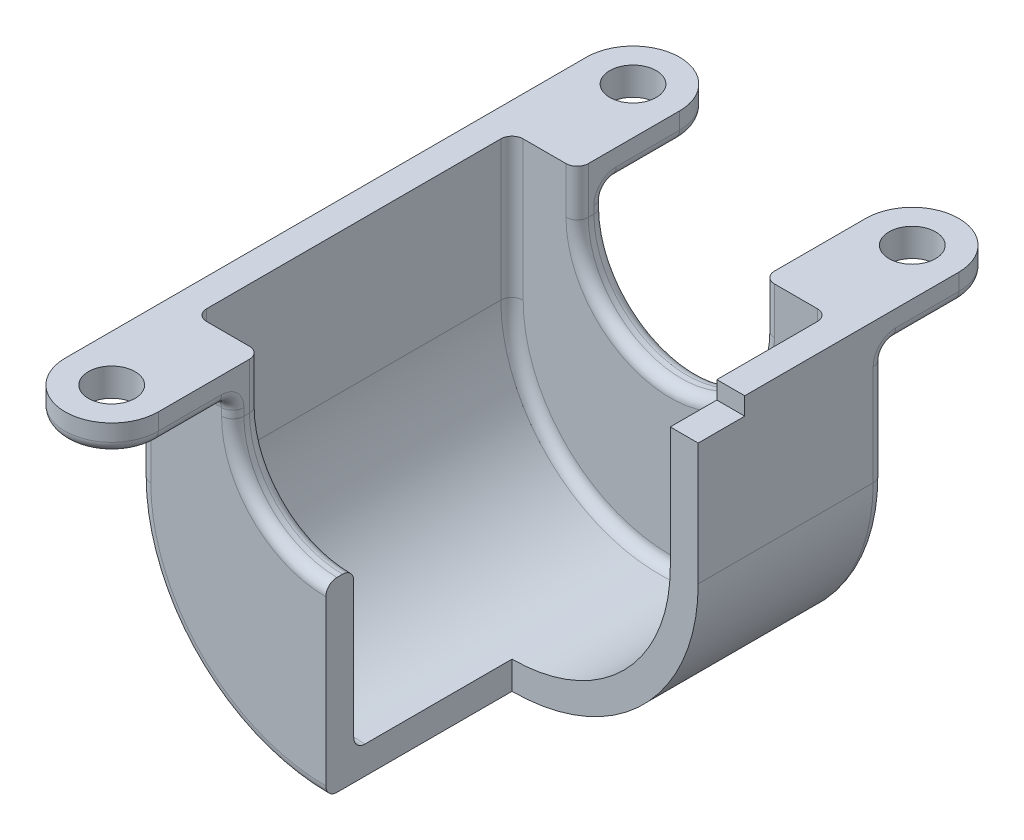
ISO-10303-21;
HEADER;
FILE_DESCRIPTION(('STEP AP214'),'2;1');
FILE_NAME('part.step','',(''),(''),'','','');
FILE_SCHEMA(('AUTOMOTIVE_DESIGN { 1 0 10303 214 1 1 1 1 }'));
ENDSEC;
DATA;
#1=APPLICATION_CONTEXT('core data for automotive mechanical design processes');
#2=APPLICATION_PROTOCOL_DEFINITION('international standard','automotive_design',2000,#1);
#3=PRODUCT_CONTEXT('',#1,'mechanical');
#4=PRODUCT('Part','Part','',(#3));
#5=PRODUCT_RELATED_PRODUCT_CATEGORY('part','',(#4));
#6=PRODUCT_DEFINITION_FORMATION('','',#4);
#7=PRODUCT_DEFINITION_CONTEXT('part definition',#1,'design');
#8=PRODUCT_DEFINITION('design','',#6,#7);
#9=PRODUCT_DEFINITION_SHAPE('','',#8);
#10=(LENGTH_UNIT() NAMED_UNIT(*) SI_UNIT(.MILLI.,.METRE.));
#11=(NAMED_UNIT(*) PLANE_ANGLE_UNIT() SI_UNIT($,.RADIAN.));
#12=(NAMED_UNIT(*) SI_UNIT($,.STERADIAN.) SOLID_ANGLE_UNIT());
#13=UNCERTAINTY_MEASURE_WITH_UNIT(LENGTH_MEASURE(1.E-05),#10,'distance_accuracy_value','');
#14=(GEOMETRIC_REPRESENTATION_CONTEXT(3) GLOBAL_UNCERTAINTY_ASSIGNED_CONTEXT((#13)) GLOBAL_UNIT_ASSIGNED_CONTEXT((#10,
#11,#12)) REPRESENTATION_CONTEXT('',''));
#15=CARTESIAN_POINT('',(0.,0.,0.));
#16=DIRECTION('',(0.,0.,1.));
#17=DIRECTION('',(1.,0.,0.));
#18=AXIS2_PLACEMENT_3D('',#15,#16,#17);
#19=CARTESIAN_POINT('',(-50.8,38.1,50.8));
#20=DIRECTION('',(0.,-1.,0.));
#21=DIRECTION('',(0.,0.,-1.));
#22=AXIS2_PLACEMENT_3D('',#19,#20,#21);
#23=PLANE('',#22);
#24=DIRECTION('',(-1.,0.,0.));
#25=VECTOR('',#24,1.);
#26=CARTESIAN_POINT('',(0.,38.1,-43.18));
#27=LINE('',#26,#25);
#28=CARTESIAN_POINT('',(-28.448,38.1,-43.18));
#29=VERTEX_POINT('',#28);
#30=CARTESIAN_POINT('',(-40.132,38.1,-43.18));
#31=VERTEX_POINT('',#30);
#32=EDGE_CURVE('E510',#29,#31,#27,.T.);
#33=ORIENTED_EDGE('',*,*,#32,.F.);
#34=CARTESIAN_POINT('',(-28.448,38.1,-46.228));
#35=DIRECTION('',(0.,-1.,0.));
#36=DIRECTION('',(0.,0.,-1.));
#37=AXIS2_PLACEMENT_3D('',#34,#35,#36);
#38=CIRCLE('',#37,3.048);
#39=CARTESIAN_POINT('',(-25.4,38.1,-46.228));
#40=VERTEX_POINT('',#39);
#41=EDGE_CURVE('E700',#29,#40,#38,.F.);
#42=ORIENTED_EDGE('',*,*,#41,.T.);
#43=DIRECTION('',(0.,0.,-1.));
#44=VECTOR('',#43,1.);
#45=CARTESIAN_POINT('',(-25.4,38.1,50.8));
#46=LINE('',#45,#44);
#47=CARTESIAN_POINT('',(-25.4,38.1,-71.12));
#48=VERTEX_POINT('',#47);
#49=EDGE_CURVE('E522',#40,#48,#46,.T.);
#50=ORIENTED_EDGE('',*,*,#49,.T.);
#51=CARTESIAN_POINT('',(-38.1,38.1,-71.12));
#52=DIRECTION('',(0.,-1.,0.));
#53=DIRECTION('',(0.,0.,1.));
#54=AXIS2_PLACEMENT_3D('',#51,#52,#53);
#55=CIRCLE('',#54,12.7);
#56=CARTESIAN_POINT('',(-50.8,38.1,-71.12));
#57=VERTEX_POINT('',#56);
#58=EDGE_CURVE('E465',#57,#48,#55,.T.);
#59=ORIENTED_EDGE('',*,*,#58,.F.);
#60=DIRECTION('',(0.,0.,-1.));
#61=VECTOR('',#60,1.);
#62=CARTESIAN_POINT('',(-50.8,38.1,50.8));
#63=LINE('',#62,#61);
#64=CARTESIAN_POINT('',(-50.8,38.1,71.12));
#65=VERTEX_POINT('',#64);
#66=EDGE_CURVE('E519',#65,#57,#63,.T.);
#67=ORIENTED_EDGE('',*,*,#66,.F.);
#68=CARTESIAN_POINT('',(-38.1,38.1,71.12));
#69=DIRECTION('',(0.,1.,0.));
#70=DIRECTION('',(0.,0.,-1.));
#71=AXIS2_PLACEMENT_3D('',#68,#69,#70);
#72=CIRCLE('',#71,12.7);
#73=CARTESIAN_POINT('',(-25.4,38.1,71.12));
#74=VERTEX_POINT('',#73);
#75=EDGE_CURVE('E489',#65,#74,#72,.T.);
#76=ORIENTED_EDGE('',*,*,#75,.T.);
#77=CARTESIAN_POINT('',(-25.4,38.1,46.228));
#78=VERTEX_POINT('',#77);
#79=EDGE_CURVE('E523',#74,#78,#46,.T.);
#80=ORIENTED_EDGE('',*,*,#79,.T.);
#81=CARTESIAN_POINT('',(-28.448,38.1,46.228));
#82=DIRECTION('',(0.,-1.,0.));
#83=DIRECTION('',(0.,0.,-1.));
#84=AXIS2_PLACEMENT_3D('',#81,#82,#83);
#85=CIRCLE('',#84,3.048);
#86=CARTESIAN_POINT('',(-28.448,38.1,43.18));
#87=VERTEX_POINT('',#86);
#88=EDGE_CURVE('E698',#78,#87,#85,.F.);
#89=ORIENTED_EDGE('',*,*,#88,.T.);
#90=DIRECTION('',(-1.,0.,0.));
#91=VECTOR('',#90,1.);
#92=CARTESIAN_POINT('',(0.,38.1,43.18));
#93=LINE('',#92,#91);
#94=CARTESIAN_POINT('',(-40.132,38.1,43.18));
#95=VERTEX_POINT('',#94);
#96=EDGE_CURVE('E505',#87,#95,#93,.T.);
#97=ORIENTED_EDGE('',*,*,#96,.T.);
#98=CARTESIAN_POINT('',(-40.132,38.1,40.132));
#99=DIRECTION('',(0.,-1.,0.));
#100=DIRECTION('',(0.,0.,-1.));
#101=AXIS2_PLACEMENT_3D('',#98,#99,#100);
#102=CIRCLE('',#101,3.048);
#103=CARTESIAN_POINT('',(-43.18,38.1,40.132));
#104=VERTEX_POINT('',#103);
#105=EDGE_CURVE('E716',#95,#104,#102,.T.);
#106=ORIENTED_EDGE('',*,*,#105,.T.);
#107=DIRECTION('',(0.,0.,-1.));
#108=VECTOR('',#107,1.);
#109=CARTESIAN_POINT('',(-43.18,38.1,50.8));
#110=LINE('',#109,#108);
#111=CARTESIAN_POINT('',(-43.18,38.1,-40.132));
#112=VERTEX_POINT('',#111);
#113=EDGE_CURVE('E504',#104,#112,#110,.T.);
#114=ORIENTED_EDGE('',*,*,#113,.T.);
#115=CARTESIAN_POINT('',(-40.132,38.1,-40.132));
#116=DIRECTION('',(0.,-1.,0.));
#117=DIRECTION('',(0.,0.,-1.));
#118=AXIS2_PLACEMENT_3D('',#115,#116,#117);
#119=CIRCLE('',#118,3.048);
#120=EDGE_CURVE('E718',#112,#31,#119,.T.);
#121=ORIENTED_EDGE('',*,*,#120,.T.);
#122=EDGE_LOOP('',(#33,#42,#50,#59,#67,#76,#80,#89,#97,#106,#114,#121));
#123=FACE_BOUND('',#122,.T.);
#124=CARTESIAN_POINT('',(-38.1,38.1,71.12));
#125=DIRECTION('',(0.,1.,0.));
#126=DIRECTION('',(0.,0.,1.));
#127=AXIS2_PLACEMENT_3D('',#124,#125,#126);
#128=CIRCLE('',#127,6.35);
#129=CARTESIAN_POINT('',(-38.1,38.1,77.47));
#130=VERTEX_POINT('',#129);
#131=EDGE_CURVE('E484',#130,#130,#128,.T.);
#132=ORIENTED_EDGE('',*,*,#131,.F.);
#133=EDGE_LOOP('',(#132));
#134=FACE_BOUND('',#133,.T.);
#135=CARTESIAN_POINT('',(-38.1,38.1,-71.12));
#136=DIRECTION('',(0.,-1.,0.));
#137=DIRECTION('',(0.,0.,-1.));
#138=AXIS2_PLACEMENT_3D('',#135,#136,#137);
#139=CIRCLE('',#138,6.35);
#140=CARTESIAN_POINT('',(-38.1,38.1,-77.47));
#141=VERTEX_POINT('',#140);
#142=EDGE_CURVE('E453',#141,#141,#139,.T.);
#143=ORIENTED_EDGE('',*,*,#142,.T.);
#144=EDGE_LOOP('',(#143));
#145=FACE_BOUND('',#144,.T.);
#146=ADVANCED_FACE('F28',(#123,#134,#145),#23,.F.);
#147=CARTESIAN_POINT('',(-38.1,30.48,-71.12));
#148=DIRECTION('',(0.,-1.,0.));
#149=DIRECTION('',(0.,0.,1.));
#150=AXIS2_PLACEMENT_3D('',#147,#148,#149);
#151=PLANE('',#150);
#152=DIRECTION('',(-1.,0.,0.));
#153=VECTOR('',#152,1.);
#154=CARTESIAN_POINT('',(-50.8,30.48,-53.848));
#155=LINE('',#154,#153);
#156=CARTESIAN_POINT('',(-28.448,30.48,-53.848));
#157=VERTEX_POINT('',#156);
#158=CARTESIAN_POINT('',(-47.752,30.48,-53.848));
#159=VERTEX_POINT('',#158);
#160=EDGE_CURVE('E539',#157,#159,#155,.T.);
#161=ORIENTED_EDGE('',*,*,#160,.T.);
#162=DIRECTION('',(0.,0.,-1.));
#163=VECTOR('',#162,1.);
#164=CARTESIAN_POINT('',(-47.752,30.48,-71.12));
#165=LINE('',#164,#163);
#166=CARTESIAN_POINT('',(-47.752,30.48,-71.12));
#167=VERTEX_POINT('',#166);
#168=EDGE_CURVE('E629',#159,#167,#165,.T.);
#169=ORIENTED_EDGE('',*,*,#168,.T.);
#170=CARTESIAN_POINT('',(-38.1,30.48,-71.12));
#171=DIRECTION('',(0.,-1.,0.));
#172=DIRECTION('',(0.,0.,-1.));
#173=AXIS2_PLACEMENT_3D('',#170,#171,#172);
#174=CIRCLE('',#173,9.65200000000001);
#175=CARTESIAN_POINT('',(-28.448,30.48,-71.12));
#176=VERTEX_POINT('',#175);
#177=EDGE_CURVE('E627',#167,#176,#174,.T.);
#178=ORIENTED_EDGE('',*,*,#177,.T.);
#179=DIRECTION('',(0.,0.,1.));
#180=VECTOR('',#179,1.);
#181=CARTESIAN_POINT('',(-28.448,30.48,-53.848));
#182=LINE('',#181,#180);
#183=EDGE_CURVE('E625',#176,#157,#182,.T.);
#184=ORIENTED_EDGE('',*,*,#183,.T.);
#185=EDGE_LOOP('',(#161,#169,#178,#184));
#186=FACE_BOUND('',#185,.T.);
#187=CARTESIAN_POINT('',(-38.1,30.48,-71.12));
#188=DIRECTION('',(0.,-1.,0.));
#189=DIRECTION('',(0.,0.,-1.));
#190=AXIS2_PLACEMENT_3D('',#187,#188,#189);
#191=CIRCLE('',#190,6.35);
#192=CARTESIAN_POINT('',(-38.1,30.48,-77.47));
#193=VERTEX_POINT('',#192);
#194=EDGE_CURVE('E464',#193,#193,#191,.F.);
#195=ORIENTED_EDGE('',*,*,#194,.T.);
#196=EDGE_LOOP('',(#195));
#197=FACE_BOUND('',#196,.T.);
#198=ADVANCED_FACE('F978',(#186,#197),#151,.T.);
#199=CARTESIAN_POINT('',(0.,0.,-50.8));
#200=DIRECTION('',(0.,0.,-1.));
#201=DIRECTION('',(-1.,0.,0.));
#202=AXIS2_PLACEMENT_3D('',#199,#200,#201);
#203=PLANE('',#202);
#204=DIRECTION('',(1.,0.,0.));
#205=VECTOR('',#204,1.);
#206=CARTESIAN_POINT('',(50.8,27.432,-50.8));
#207=LINE('',#206,#205);
#208=CARTESIAN_POINT('',(28.448,27.432,-50.8));
#209=VERTEX_POINT('',#208);
#210=CARTESIAN_POINT('',(47.752,27.432,-50.8));
#211=VERTEX_POINT('',#210);
#212=EDGE_CURVE('E548',#209,#211,#207,.T.);
#213=ORIENTED_EDGE('',*,*,#212,.T.);
#214=DIRECTION('',(0.,1.,0.));
#215=VECTOR('',#214,1.);
#216=CARTESIAN_POINT('',(47.752,0.,-50.8));
#217=LINE('',#216,#215);
#218=CARTESIAN_POINT('',(47.752,0.,-50.8));
#219=VERTEX_POINT('',#218);
#220=EDGE_CURVE('E578',#211,#219,#217,.F.);
#221=ORIENTED_EDGE('',*,*,#220,.T.);
#222=CARTESIAN_POINT('',(0.,0.,-50.8));
#223=DIRECTION('',(0.,0.,-1.));
#224=DIRECTION('',(-1.,0.,0.));
#225=AXIS2_PLACEMENT_3D('',#222,#223,#224);
#226=CIRCLE('',#225,47.752);
#227=CARTESIAN_POINT('',(-47.752,0.,-50.8));
#228=VERTEX_POINT('',#227);
#229=EDGE_CURVE('E575',#219,#228,#226,.T.);
#230=ORIENTED_EDGE('',*,*,#229,.T.);
#231=DIRECTION('',(0.,-1.,0.));
#232=VECTOR('',#231,1.);
#233=CARTESIAN_POINT('',(-47.752,27.432,-50.8));
#234=LINE('',#233,#232);
#235=CARTESIAN_POINT('',(-47.752,27.432,-50.8));
#236=VERTEX_POINT('',#235);
#237=EDGE_CURVE('E573',#228,#236,#234,.F.);
#238=ORIENTED_EDGE('',*,*,#237,.T.);
#239=DIRECTION('',(-1.,0.,0.));
#240=VECTOR('',#239,1.);
#241=CARTESIAN_POINT('',(-25.4,27.432,-50.8));
#242=LINE('',#241,#240);
#243=CARTESIAN_POINT('',(-28.448,27.432,-50.8));
#244=VERTEX_POINT('',#243);
#245=EDGE_CURVE('E551',#236,#244,#242,.F.);
#246=ORIENTED_EDGE('',*,*,#245,.T.);
#247=DIRECTION('',(0.,1.,0.));
#248=VECTOR('',#247,1.);
#249=CARTESIAN_POINT('',(-28.448,25.4,-50.8));
#250=LINE('',#249,#248);
#251=CARTESIAN_POINT('',(-28.448,25.4,-50.8));
#252=VERTEX_POINT('',#251);
#253=EDGE_CURVE('E569',#244,#252,#250,.F.);
#254=ORIENTED_EDGE('',*,*,#253,.T.);
#255=CARTESIAN_POINT('',(0.,25.4,-50.8));
#256=DIRECTION('',(0.,0.,-1.));
#257=DIRECTION('',(-1.,0.,0.));
#258=AXIS2_PLACEMENT_3D('',#255,#256,#257);
#259=CIRCLE('',#258,28.448);
#260=CARTESIAN_POINT('',(28.448,25.4,-50.8));
#261=VERTEX_POINT('',#260);
#262=EDGE_CURVE('E567',#252,#261,#259,.F.);
#263=ORIENTED_EDGE('',*,*,#262,.T.);
#264=DIRECTION('',(0.,-1.,0.));
#265=VECTOR('',#264,1.);
#266=CARTESIAN_POINT('',(28.448,27.432,-50.8));
#267=LINE('',#266,#265);
#268=EDGE_CURVE('E571',#261,#209,#267,.F.);
#269=ORIENTED_EDGE('',*,*,#268,.T.);
#270=EDGE_LOOP('',(#213,#221,#230,#238,#246,#254,#263,#269));
#271=FACE_BOUND('',#270,.T.);
#272=ADVANCED_FACE('F947',(#271),#203,.T.);
#273=CARTESIAN_POINT('',(50.8,38.1,50.8));
#274=DIRECTION('',(0.,-1.,0.));
#275=DIRECTION('',(0.,0.,-1.));
#276=AXIS2_PLACEMENT_3D('',#273,#274,#275);
#277=PLANE('',#276);
#278=CARTESIAN_POINT('',(38.1,38.1,-71.12));
#279=DIRECTION('',(0.,1.,0.));
#280=DIRECTION('',(0.,0.,-1.));
#281=AXIS2_PLACEMENT_3D('',#278,#279,#280);
#282=CIRCLE('',#281,6.35);
#283=CARTESIAN_POINT('',(38.1,38.1,-77.47));
#284=VERTEX_POINT('',#283);
#285=EDGE_CURVE('E471',#284,#284,#282,.T.);
#286=ORIENTED_EDGE('',*,*,#285,.F.);
#287=EDGE_LOOP('',(#286));
#288=FACE_BOUND('',#287,.T.);
#289=DIRECTION('',(0.,0.,-1.));
#290=VECTOR('',#289,1.);
#291=CARTESIAN_POINT('',(25.4,38.1,50.8));
#292=LINE('',#291,#290);
#293=CARTESIAN_POINT('',(25.4,38.1,-46.228));
#294=VERTEX_POINT('',#293);
#295=CARTESIAN_POINT('',(25.4,38.1,-71.12));
#296=VERTEX_POINT('',#295);
#297=EDGE_CURVE('E533',#294,#296,#292,.T.);
#298=ORIENTED_EDGE('',*,*,#297,.F.);
#299=CARTESIAN_POINT('',(28.448,38.1,-46.228));
#300=DIRECTION('',(0.,-1.,0.));
#301=DIRECTION('',(0.,0.,-1.));
#302=AXIS2_PLACEMENT_3D('',#299,#300,#301);
#303=CIRCLE('',#302,3.048);
#304=CARTESIAN_POINT('',(28.448,38.1,-43.18));
#305=VERTEX_POINT('',#304);
#306=EDGE_CURVE('E696',#294,#305,#303,.F.);
#307=ORIENTED_EDGE('',*,*,#306,.T.);
#308=DIRECTION('',(-1.,0.,0.));
#309=VECTOR('',#308,1.);
#310=CARTESIAN_POINT('',(0.,38.1,-43.18));
#311=LINE('',#310,#309);
#312=CARTESIAN_POINT('',(40.132,38.1,-43.18));
#313=VERTEX_POINT('',#312);
#314=EDGE_CURVE('E495',#313,#305,#311,.T.);
#315=ORIENTED_EDGE('',*,*,#314,.F.);
#316=CARTESIAN_POINT('',(40.132,38.1,-40.132));
#317=DIRECTION('',(0.,-1.,0.));
#318=DIRECTION('',(0.,0.,-1.));
#319=AXIS2_PLACEMENT_3D('',#316,#317,#318);
#320=CIRCLE('',#319,3.048);
#321=CARTESIAN_POINT('',(43.18,38.1,-40.132));
#322=VERTEX_POINT('',#321);
#323=EDGE_CURVE('E720',#313,#322,#320,.T.);
#324=ORIENTED_EDGE('',*,*,#323,.T.);
#325=DIRECTION('',(0.,0.,-1.));
#326=VECTOR('',#325,1.);
#327=CARTESIAN_POINT('',(43.18,38.1,50.8));
#328=LINE('',#327,#326);
#329=CARTESIAN_POINT('',(43.18,38.1,-12.7));
#330=VERTEX_POINT('',#329);
#331=EDGE_CURVE('E500',#330,#322,#328,.T.);
#332=ORIENTED_EDGE('',*,*,#331,.F.);
#333=DIRECTION('',(1.,0.,0.));
#334=VECTOR('',#333,1.);
#335=CARTESIAN_POINT('',(-50.80105,38.1,-12.7));
#336=LINE('',#335,#334);
#337=CARTESIAN_POINT('',(50.8,38.1,-12.7));
#338=VERTEX_POINT('',#337);
#339=EDGE_CURVE('E450',#330,#338,#336,.T.);
#340=ORIENTED_EDGE('',*,*,#339,.T.);
#341=DIRECTION('',(0.,0.,-1.));
#342=VECTOR('',#341,1.);
#343=CARTESIAN_POINT('',(50.8,38.1,50.8));
#344=LINE('',#343,#342);
#345=CARTESIAN_POINT('',(50.8,38.1,-71.12));
#346=VERTEX_POINT('',#345);
#347=EDGE_CURVE('E535',#338,#346,#344,.T.);
#348=ORIENTED_EDGE('',*,*,#347,.T.);
#349=CARTESIAN_POINT('',(38.1,38.1,-71.12));
#350=DIRECTION('',(0.,1.,0.));
#351=DIRECTION('',(0.,0.,1.));
#352=AXIS2_PLACEMENT_3D('',#349,#350,#351);
#353=CIRCLE('',#352,12.7);
#354=EDGE_CURVE('E477',#346,#296,#353,.T.);
#355=ORIENTED_EDGE('',*,*,#354,.T.);
#356=EDGE_LOOP('',(#298,#307,#315,#324,#332,#340,#348,#355));
#357=FACE_BOUND('',#356,.T.);
#358=ADVANCED_FACE('F851',(#288,#357),#277,.F.);
#359=CARTESIAN_POINT('',(25.4,38.1,50.8));
#360=DIRECTION('',(1.,0.,0.));
#361=DIRECTION('',(0.,1.,0.));
#362=AXIS2_PLACEMENT_3D('',#359,#360,#361);
#363=PLANE('',#362);
#364=DIRECTION('',(0.,1.,0.));
#365=VECTOR('',#364,1.);
#366=CARTESIAN_POINT('',(25.4,30.48,-71.12));
#367=LINE('',#366,#365);
#368=CARTESIAN_POINT('',(25.4,33.528,-71.12));
#369=VERTEX_POINT('',#368);
#370=EDGE_CURVE('E481',#369,#296,#367,.T.);
#371=ORIENTED_EDGE('',*,*,#370,.F.);
#372=DIRECTION('',(0.,0.,1.));
#373=VECTOR('',#372,1.);
#374=CARTESIAN_POINT('',(25.4,33.528,-53.848));
#375=LINE('',#374,#373);
#376=CARTESIAN_POINT('',(25.4,33.528,-53.848));
#377=VERTEX_POINT('',#376);
#378=EDGE_CURVE('E649',#369,#377,#375,.T.);
#379=ORIENTED_EDGE('',*,*,#378,.T.);
#380=CARTESIAN_POINT('',(25.4,27.432,-53.848));
#381=DIRECTION('',(1.,0.,0.));
#382=DIRECTION('',(0.,1.,0.));
#383=AXIS2_PLACEMENT_3D('',#380,#381,#382);
#384=CIRCLE('',#383,6.096);
#385=CARTESIAN_POINT('',(25.4,27.432,-47.752));
#386=VERTEX_POINT('',#385);
#387=EDGE_CURVE('E647',#377,#386,#384,.T.);
#388=ORIENTED_EDGE('',*,*,#387,.T.);
#389=DIRECTION('',(0.,-1.,0.));
#390=VECTOR('',#389,1.);
#391=CARTESIAN_POINT('',(25.4,25.4,-47.752));
#392=LINE('',#391,#390);
#393=CARTESIAN_POINT('',(25.4,25.4,-47.752));
#394=VERTEX_POINT('',#393);
#395=EDGE_CURVE('E645',#386,#394,#392,.T.);
#396=ORIENTED_EDGE('',*,*,#395,.T.);
#397=DIRECTION('',(0.,0.,-1.));
#398=VECTOR('',#397,1.);
#399=CARTESIAN_POINT('',(25.4,25.4,50.8));
#400=LINE('',#399,#398);
#401=CARTESIAN_POINT('',(25.4,25.4,-46.228));
#402=VERTEX_POINT('',#401);
#403=EDGE_CURVE('E530',#402,#394,#400,.T.);
#404=ORIENTED_EDGE('',*,*,#403,.F.);
#405=DIRECTION('',(0.,-1.,0.));
#406=VECTOR('',#405,1.);
#407=CARTESIAN_POINT('',(25.4,38.1,-46.228));
#408=LINE('',#407,#406);
#409=EDGE_CURVE('E643',#402,#294,#408,.F.);
#410=ORIENTED_EDGE('',*,*,#409,.T.);
#411=ORIENTED_EDGE('',*,*,#297,.T.);
#412=EDGE_LOOP('',(#371,#379,#388,#396,#404,#410,#411));
#413=FACE_BOUND('',#412,.T.);
#414=ADVANCED_FACE('F842',(#413),#363,.F.);
#415=CARTESIAN_POINT('',(0.,25.4,50.8));
#416=DIRECTION('',(0.,0.,-1.));
#417=DIRECTION('',(-1.,0.,0.));
#418=AXIS2_PLACEMENT_3D('',#415,#416,#417);
#419=CYLINDRICAL_SURFACE('',#418,25.4);
#420=ORIENTED_EDGE('',*,*,#403,.T.);
#421=CARTESIAN_POINT('',(0.,25.4,-47.752));
#422=DIRECTION('',(0.,0.,-1.));
#423=DIRECTION('',(-1.,0.,0.));
#424=AXIS2_PLACEMENT_3D('',#421,#422,#423);
#425=CIRCLE('',#424,25.4);
#426=CARTESIAN_POINT('',(-25.4,25.4,-47.752));
#427=VERTEX_POINT('',#426);
#428=EDGE_CURVE('E709',#394,#427,#425,.T.);
#429=ORIENTED_EDGE('',*,*,#428,.T.);
#430=DIRECTION('',(0.,0.,-1.));
#431=VECTOR('',#430,1.);
#432=CARTESIAN_POINT('',(-25.4,25.4,50.8));
#433=LINE('',#432,#431);
#434=CARTESIAN_POINT('',(-25.4,25.4,-46.228));
#435=VERTEX_POINT('',#434);
#436=EDGE_CURVE('E526',#435,#427,#433,.T.);
#437=ORIENTED_EDGE('',*,*,#436,.F.);
#438=CARTESIAN_POINT('',(0.,25.4,-46.228));
#439=DIRECTION('',(0.,0.,-1.));
#440=DIRECTION('',(-1.,0.,0.));
#441=AXIS2_PLACEMENT_3D('',#438,#439,#440);
#442=CIRCLE('',#441,25.4);
#443=EDGE_CURVE('E707',#435,#402,#442,.F.);
#444=ORIENTED_EDGE('',*,*,#443,.T.);
#445=EDGE_LOOP('',(#420,#429,#437,#444));
#446=FACE_BOUND('',#445,.T.);
#447=ADVANCED_FACE('F836',(#446),#419,.F.);
#448=CARTESIAN_POINT('',(-25.4,38.1,50.8));
#449=DIRECTION('',(-1.,0.,0.));
#450=DIRECTION('',(0.,-1.,0.));
#451=AXIS2_PLACEMENT_3D('',#448,#449,#450);
#452=PLANE('',#451);
#453=CARTESIAN_POINT('',(-25.4,27.432,-53.848));
#454=DIRECTION('',(-1.,0.,0.));
#455=DIRECTION('',(0.,-1.,0.));
#456=AXIS2_PLACEMENT_3D('',#453,#454,#455);
#457=CIRCLE('',#456,6.096);
#458=CARTESIAN_POINT('',(-25.4,27.432,-47.752));
#459=VERTEX_POINT('',#458);
#460=CARTESIAN_POINT('',(-25.4,33.528,-53.848));
#461=VERTEX_POINT('',#460);
#462=EDGE_CURVE('E655',#459,#461,#457,.T.);
#463=ORIENTED_EDGE('',*,*,#462,.T.);
#464=DIRECTION('',(0.,0.,1.));
#465=VECTOR('',#464,1.);
#466=CARTESIAN_POINT('',(-25.4,33.528,-71.12));
#467=LINE('',#466,#465);
#468=CARTESIAN_POINT('',(-25.4,33.528,-71.12));
#469=VERTEX_POINT('',#468);
#470=EDGE_CURVE('E657',#461,#469,#467,.F.);
#471=ORIENTED_EDGE('',*,*,#470,.T.);
#472=DIRECTION('',(0.,1.,0.));
#473=VECTOR('',#472,1.);
#474=CARTESIAN_POINT('',(-25.4,30.48,-71.12));
#475=LINE('',#474,#473);
#476=EDGE_CURVE('E468',#469,#48,#475,.T.);
#477=ORIENTED_EDGE('',*,*,#476,.T.);
#478=ORIENTED_EDGE('',*,*,#49,.F.);
#479=DIRECTION('',(0.,1.,0.));
#480=VECTOR('',#479,1.);
#481=CARTESIAN_POINT('',(-25.4,38.1,-46.228));
#482=LINE('',#481,#480);
#483=EDGE_CURVE('E651',#40,#435,#482,.F.);
#484=ORIENTED_EDGE('',*,*,#483,.T.);
#485=ORIENTED_EDGE('',*,*,#436,.T.);
#486=DIRECTION('',(0.,1.,0.));
#487=VECTOR('',#486,1.);
#488=CARTESIAN_POINT('',(-25.4,27.432,-47.752));
#489=LINE('',#488,#487);
#490=EDGE_CURVE('E653',#427,#459,#489,.T.);
#491=ORIENTED_EDGE('',*,*,#490,.T.);
#492=EDGE_LOOP('',(#463,#471,#477,#478,#484,#485,#491));
#493=FACE_BOUND('',#492,.T.);
#494=ADVANCED_FACE('F894',(#493),#452,.F.);
#495=CARTESIAN_POINT('',(0.,0.,50.8));
#496=DIRECTION('',(0.,0.,-1.));
#497=DIRECTION('',(-1.,0.,0.));
#498=AXIS2_PLACEMENT_3D('',#495,#496,#497);
#499=CYLINDRICAL_SURFACE('',#498,50.8);
#500=CARTESIAN_POINT('',(0.,0.,0.));
#501=DIRECTION('',(0.,0.,-1.));
#502=DIRECTION('',(-1.,0.,0.));
#503=AXIS2_PLACEMENT_3D('',#500,#501,#502);
#504=CIRCLE('',#503,50.8);
#505=CARTESIAN_POINT('',(50.8,0.,0.));
#506=VERTEX_POINT('',#505);
#507=CARTESIAN_POINT('',(0.,-50.8,0.));
#508=VERTEX_POINT('',#507);
#509=EDGE_CURVE('E347',#506,#508,#504,.T.);
#510=ORIENTED_EDGE('',*,*,#509,.T.);
#511=DIRECTION('',(0.,0.,-1.));
#512=VECTOR('',#511,1.);
#513=CARTESIAN_POINT('',(0.,-50.8,50.8));
#514=LINE('',#513,#512);
#515=CARTESIAN_POINT('',(0.,-50.8,47.752));
#516=VERTEX_POINT('',#515);
#517=EDGE_CURVE('E333',#508,#516,#514,.F.);
#518=ORIENTED_EDGE('',*,*,#517,.T.);
#519=CARTESIAN_POINT('',(0.,0.,47.752));
#520=DIRECTION('',(0.,0.,-1.));
#521=DIRECTION('',(-1.,0.,0.));
#522=AXIS2_PLACEMENT_3D('',#519,#520,#521);
#523=CIRCLE('',#522,50.8);
#524=CARTESIAN_POINT('',(-50.8,0.,47.752));
#525=VERTEX_POINT('',#524);
#526=EDGE_CURVE('E563',#516,#525,#523,.T.);
#527=ORIENTED_EDGE('',*,*,#526,.T.);
#528=DIRECTION('',(0.,0.,-1.));
#529=VECTOR('',#528,1.);
#530=CARTESIAN_POINT('',(-50.8,0.,50.8));
#531=LINE('',#530,#529);
#532=CARTESIAN_POINT('',(-50.8,0.,-47.752));
#533=VERTEX_POINT('',#532);
#534=EDGE_CURVE('E499',#525,#533,#531,.T.);
#535=ORIENTED_EDGE('',*,*,#534,.T.);
#536=CARTESIAN_POINT('',(0.,0.,-47.752));
#537=DIRECTION('',(0.,0.,-1.));
#538=DIRECTION('',(-1.,0.,0.));
#539=AXIS2_PLACEMENT_3D('',#536,#537,#538);
#540=CIRCLE('',#539,50.8);
#541=CARTESIAN_POINT('',(50.8,0.,-47.752));
#542=VERTEX_POINT('',#541);
#543=EDGE_CURVE('E565',#533,#542,#540,.F.);
#544=ORIENTED_EDGE('',*,*,#543,.T.);
#545=DIRECTION('',(0.,0.,-1.));
#546=VECTOR('',#545,1.);
#547=CARTESIAN_POINT('',(50.8,0.,50.8));
#548=LINE('',#547,#546);
#549=EDGE_CURVE('E355',#506,#542,#548,.T.);
#550=ORIENTED_EDGE('',*,*,#549,.F.);
#551=EDGE_LOOP('',(#510,#518,#527,#535,#544,#550));
#552=FACE_BOUND('',#551,.T.);
#553=ADVANCED_FACE('F30',(#552),#499,.T.);
#554=CARTESIAN_POINT('',(50.8,0.,50.8));
#555=DIRECTION('',(-1.,0.,0.));
#556=DIRECTION('',(0.,-1.,0.));
#557=AXIS2_PLACEMENT_3D('',#554,#555,#556);
#558=PLANE('',#557);
#559=DIRECTION('',(0.,0.,-1.));
#560=VECTOR('',#559,1.);
#561=CARTESIAN_POINT('',(50.8,33.274,12.7));
#562=LINE('',#561,#560);
#563=CARTESIAN_POINT('',(50.8,33.274,0.));
#564=VERTEX_POINT('',#563);
#565=CARTESIAN_POINT('',(50.8,33.274,-12.7));
#566=VERTEX_POINT('',#565);
#567=EDGE_CURVE('E454',#564,#566,#562,.T.);
#568=ORIENTED_EDGE('',*,*,#567,.F.);
#569=DIRECTION('',(0.,1.,0.));
#570=VECTOR('',#569,1.);
#571=CARTESIAN_POINT('',(50.8,-74.295,0.));
#572=LINE('',#571,#570);
#573=EDGE_CURVE('E351',#506,#564,#572,.T.);
#574=ORIENTED_EDGE('',*,*,#573,.F.);
#575=ORIENTED_EDGE('',*,*,#549,.T.);
#576=DIRECTION('',(0.,1.,0.));
#577=VECTOR('',#576,1.);
#578=CARTESIAN_POINT('',(50.8,27.432,-47.752));
#579=LINE('',#578,#577);
#580=CARTESIAN_POINT('',(50.8,27.432,-47.752));
#581=VERTEX_POINT('',#580);
#582=EDGE_CURVE('E593',#542,#581,#579,.T.);
#583=ORIENTED_EDGE('',*,*,#582,.T.);
#584=CARTESIAN_POINT('',(50.8,27.432,-53.848));
#585=DIRECTION('',(-1.,0.,0.));
#586=DIRECTION('',(0.,-1.,0.));
#587=AXIS2_PLACEMENT_3D('',#584,#585,#586);
#588=CIRCLE('',#587,6.096);
#589=CARTESIAN_POINT('',(50.8,33.528,-53.848));
#590=VERTEX_POINT('',#589);
#591=EDGE_CURVE('E591',#581,#590,#588,.T.);
#592=ORIENTED_EDGE('',*,*,#591,.T.);
#593=DIRECTION('',(0.,0.,-1.));
#594=VECTOR('',#593,1.);
#595=CARTESIAN_POINT('',(50.8,33.528,-71.12));
#596=LINE('',#595,#594);
#597=CARTESIAN_POINT('',(50.8,33.528,-71.12));
#598=VERTEX_POINT('',#597);
#599=EDGE_CURVE('E589',#590,#598,#596,.T.);
#600=ORIENTED_EDGE('',*,*,#599,.T.);
#601=DIRECTION('',(0.,1.,0.));
#602=VECTOR('',#601,1.);
#603=CARTESIAN_POINT('',(50.8,30.48,-71.12));
#604=LINE('',#603,#602);
#605=EDGE_CURVE('E480',#598,#346,#604,.T.);
#606=ORIENTED_EDGE('',*,*,#605,.T.);
#607=ORIENTED_EDGE('',*,*,#347,.F.);
#608=DIRECTION('',(0.,1.,0.));
#609=VECTOR('',#608,1.);
#610=CARTESIAN_POINT('',(50.8,38.1,-12.7));
#611=LINE('',#610,#609);
#612=EDGE_CURVE('E451',#566,#338,#611,.T.);
#613=ORIENTED_EDGE('',*,*,#612,.F.);
#614=EDGE_LOOP('',(#568,#574,#575,#583,#592,#600,#606,#607,#613));
#615=FACE_BOUND('',#614,.T.);
#616=ADVANCED_FACE('F943',(#615),#558,.F.);
#617=CARTESIAN_POINT('',(0.,25.4,47.752));
#618=DIRECTION('',(0.,0.,-1.));
#619=DIRECTION('',(-1.,0.,0.));
#620=AXIS2_PLACEMENT_3D('',#617,#618,#619);
#621=CIRCLE('',#620,25.4);
#622=CARTESIAN_POINT('',(-25.4,25.4,47.752));
#623=VERTEX_POINT('',#622);
#624=CARTESIAN_POINT('',(0.,0.,47.752));
#625=VERTEX_POINT('',#624);
#626=EDGE_CURVE('E713',#623,#625,#621,.F.);
#627=ORIENTED_EDGE('',*,*,#626,.T.);
#628=DIRECTION('',(0.,0.,-1.));
#629=VECTOR('',#628,1.);
#630=CARTESIAN_POINT('',(0.,0.,50.8));
#631=LINE('',#630,#629);
#632=CARTESIAN_POINT('',(0.,0.,46.228));
#633=VERTEX_POINT('',#632);
#634=EDGE_CURVE('E722',#625,#633,#631,.T.);
#635=ORIENTED_EDGE('',*,*,#634,.T.);
#636=CARTESIAN_POINT('',(0.,25.4,46.228));
#637=DIRECTION('',(0.,0.,-1.));
#638=DIRECTION('',(-1.,0.,0.));
#639=AXIS2_PLACEMENT_3D('',#636,#637,#638);
#640=CIRCLE('',#639,25.4);
#641=CARTESIAN_POINT('',(-25.4,25.4,46.228));
#642=VERTEX_POINT('',#641);
#643=EDGE_CURVE('E711',#633,#642,#640,.T.);
#644=ORIENTED_EDGE('',*,*,#643,.T.);
#645=EDGE_CURVE('E527',#623,#642,#433,.T.);
#646=ORIENTED_EDGE('',*,*,#645,.F.);
#647=EDGE_LOOP('',(#627,#635,#644,#646));
#648=FACE_BOUND('',#647,.T.);
#649=ADVANCED_FACE('F728',(#648),#419,.F.);
#650=DIRECTION('',(0.,1.,0.));
#651=VECTOR('',#650,1.);
#652=CARTESIAN_POINT('',(-25.4,30.48,71.12));
#653=LINE('',#652,#651);
#654=CARTESIAN_POINT('',(-25.4,33.528,71.12));
#655=VERTEX_POINT('',#654);
#656=EDGE_CURVE('E493',#655,#74,#653,.T.);
#657=ORIENTED_EDGE('',*,*,#656,.F.);
#658=DIRECTION('',(0.,0.,-1.));
#659=VECTOR('',#658,1.);
#660=CARTESIAN_POINT('',(-25.4,33.528,53.848));
#661=LINE('',#660,#659);
#662=CARTESIAN_POINT('',(-25.4,33.528,53.848));
#663=VERTEX_POINT('',#662);
#664=EDGE_CURVE('E665',#655,#663,#661,.T.);
#665=ORIENTED_EDGE('',*,*,#664,.T.);
#666=CARTESIAN_POINT('',(-25.4,27.432,53.848));
#667=DIRECTION('',(-1.,0.,0.));
#668=DIRECTION('',(0.,-1.,0.));
#669=AXIS2_PLACEMENT_3D('',#666,#667,#668);
#670=CIRCLE('',#669,6.096);
#671=CARTESIAN_POINT('',(-25.4,27.432,47.752));
#672=VERTEX_POINT('',#671);
#673=EDGE_CURVE('E663',#663,#672,#670,.T.);
#674=ORIENTED_EDGE('',*,*,#673,.T.);
#675=DIRECTION('',(0.,1.,0.));
#676=VECTOR('',#675,1.);
#677=CARTESIAN_POINT('',(-25.4,38.1,47.752));
#678=LINE('',#677,#676);
#679=EDGE_CURVE('E661',#672,#623,#678,.F.);
#680=ORIENTED_EDGE('',*,*,#679,.T.);
#681=ORIENTED_EDGE('',*,*,#645,.T.);
#682=DIRECTION('',(0.,1.,0.));
#683=VECTOR('',#682,1.);
#684=CARTESIAN_POINT('',(-25.4,38.1,46.228));
#685=LINE('',#684,#683);
#686=EDGE_CURVE('E659',#642,#78,#685,.T.);
#687=ORIENTED_EDGE('',*,*,#686,.T.);
#688=ORIENTED_EDGE('',*,*,#79,.F.);
#689=EDGE_LOOP('',(#657,#665,#674,#680,#681,#687,#688));
#690=FACE_BOUND('',#689,.T.);
#691=ADVANCED_FACE('F743',(#690),#452,.F.);
#692=CARTESIAN_POINT('',(-50.8,0.,50.8));
#693=DIRECTION('',(1.,0.,0.));
#694=DIRECTION('',(0.,0.,-1.));
#695=AXIS2_PLACEMENT_3D('',#692,#693,#694);
#696=PLANE('',#695);
#697=CARTESIAN_POINT('',(-50.8,27.432,-53.848));
#698=DIRECTION('',(1.,0.,0.));
#699=DIRECTION('',(0.,0.,-1.));
#700=AXIS2_PLACEMENT_3D('',#697,#698,#699);
#701=CIRCLE('',#700,6.096);
#702=CARTESIAN_POINT('',(-50.8,33.528,-53.848));
#703=VERTEX_POINT('',#702);
#704=CARTESIAN_POINT('',(-50.8,27.432,-47.752));
#705=VERTEX_POINT('',#704);
#706=EDGE_CURVE('E603',#703,#705,#701,.T.);
#707=ORIENTED_EDGE('',*,*,#706,.T.);
#708=DIRECTION('',(0.,-1.,0.));
#709=VECTOR('',#708,1.);
#710=CARTESIAN_POINT('',(-50.8,0.,-47.752));
#711=LINE('',#710,#709);
#712=EDGE_CURVE('E605',#705,#533,#711,.T.);
#713=ORIENTED_EDGE('',*,*,#712,.T.);
#714=ORIENTED_EDGE('',*,*,#534,.F.);
#715=DIRECTION('',(0.,-1.,0.));
#716=VECTOR('',#715,1.);
#717=CARTESIAN_POINT('',(-50.8,0.,47.752));
#718=LINE('',#717,#716);
#719=CARTESIAN_POINT('',(-50.8,27.432,47.752));
#720=VERTEX_POINT('',#719);
#721=EDGE_CURVE('E599',#525,#720,#718,.F.);
#722=ORIENTED_EDGE('',*,*,#721,.T.);
#723=CARTESIAN_POINT('',(-50.8,27.432,53.848));
#724=DIRECTION('',(1.,0.,0.));
#725=DIRECTION('',(0.,0.,-1.));
#726=AXIS2_PLACEMENT_3D('',#723,#724,#725);
#727=CIRCLE('',#726,6.096);
#728=CARTESIAN_POINT('',(-50.8,33.528,53.848));
#729=VERTEX_POINT('',#728);
#730=EDGE_CURVE('E597',#720,#729,#727,.T.);
#731=ORIENTED_EDGE('',*,*,#730,.T.);
#732=DIRECTION('',(0.,0.,1.));
#733=VECTOR('',#732,1.);
#734=CARTESIAN_POINT('',(-50.8,33.528,71.12));
#735=LINE('',#734,#733);
#736=CARTESIAN_POINT('',(-50.8,33.528,71.12));
#737=VERTEX_POINT('',#736);
#738=EDGE_CURVE('E595',#729,#737,#735,.T.);
#739=ORIENTED_EDGE('',*,*,#738,.T.);
#740=DIRECTION('',(0.,1.,0.));
#741=VECTOR('',#740,1.);
#742=CARTESIAN_POINT('',(-50.8,30.48,71.12));
#743=LINE('',#742,#741);
#744=EDGE_CURVE('E492',#737,#65,#743,.T.);
#745=ORIENTED_EDGE('',*,*,#744,.T.);
#746=ORIENTED_EDGE('',*,*,#66,.T.);
#747=DIRECTION('',(0.,1.,0.));
#748=VECTOR('',#747,1.);
#749=CARTESIAN_POINT('',(-50.8,30.48,-71.12));
#750=LINE('',#749,#748);
#751=CARTESIAN_POINT('',(-50.8,33.528,-71.12));
#752=VERTEX_POINT('',#751);
#753=EDGE_CURVE('E469',#752,#57,#750,.T.);
#754=ORIENTED_EDGE('',*,*,#753,.F.);
#755=DIRECTION('',(0.,0.,-1.));
#756=VECTOR('',#755,1.);
#757=CARTESIAN_POINT('',(-50.8,33.528,-53.848));
#758=LINE('',#757,#756);
#759=EDGE_CURVE('E601',#752,#703,#758,.F.);
#760=ORIENTED_EDGE('',*,*,#759,.T.);
#761=EDGE_LOOP('',(#707,#713,#714,#722,#731,#739,#745,#746,#754,#760));
#762=FACE_BOUND('',#761,.T.);
#763=ADVANCED_FACE('F905',(#762),#696,.F.);
#764=CARTESIAN_POINT('',(0.,0.,50.8));
#765=DIRECTION('',(0.,0.,-1.));
#766=DIRECTION('',(-1.,0.,0.));
#767=AXIS2_PLACEMENT_3D('',#764,#765,#766);
#768=PLANE('',#767);
#769=CARTESIAN_POINT('',(0.,0.,50.8));
#770=DIRECTION('',(0.,0.,-1.));
#771=DIRECTION('',(-1.,0.,0.));
#772=AXIS2_PLACEMENT_3D('',#769,#770,#771);
#773=CIRCLE('',#772,47.752);
#774=CARTESIAN_POINT('',(-47.752,0.,50.8));
#775=VERTEX_POINT('',#774);
#776=CARTESIAN_POINT('',(0.,-47.752,50.8));
#777=VERTEX_POINT('',#776);
#778=EDGE_CURVE('E586',#775,#777,#773,.F.);
#779=ORIENTED_EDGE('',*,*,#778,.T.);
#780=DIRECTION('',(0.,1.,0.));
#781=VECTOR('',#780,1.);
#782=CARTESIAN_POINT('',(0.,0.,50.8));
#783=LINE('',#782,#781);
#784=CARTESIAN_POINT('',(0.,-3.04799999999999,50.8));
#785=VERTEX_POINT('',#784);
#786=EDGE_CURVE('E788',#777,#785,#783,.T.);
#787=ORIENTED_EDGE('',*,*,#786,.T.);
#788=CARTESIAN_POINT('',(0.,25.4,50.8));
#789=DIRECTION('',(0.,0.,-1.));
#790=DIRECTION('',(-1.,0.,0.));
#791=AXIS2_PLACEMENT_3D('',#788,#789,#790);
#792=CIRCLE('',#791,28.448);
#793=CARTESIAN_POINT('',(-28.448,25.4,50.8));
#794=VERTEX_POINT('',#793);
#795=EDGE_CURVE('E580',#785,#794,#792,.T.);
#796=ORIENTED_EDGE('',*,*,#795,.T.);
#797=DIRECTION('',(0.,1.,0.));
#798=VECTOR('',#797,1.);
#799=CARTESIAN_POINT('',(-28.448,0.,50.8));
#800=LINE('',#799,#798);
#801=CARTESIAN_POINT('',(-28.448,27.432,50.8));
#802=VERTEX_POINT('',#801);
#803=EDGE_CURVE('E582',#794,#802,#800,.T.);
#804=ORIENTED_EDGE('',*,*,#803,.T.);
#805=DIRECTION('',(-1.,0.,0.));
#806=VECTOR('',#805,1.);
#807=CARTESIAN_POINT('',(0.,27.432,50.8));
#808=LINE('',#807,#806);
#809=CARTESIAN_POINT('',(-47.752,27.432,50.8));
#810=VERTEX_POINT('',#809);
#811=EDGE_CURVE('E557',#802,#810,#808,.T.);
#812=ORIENTED_EDGE('',*,*,#811,.T.);
#813=DIRECTION('',(0.,-1.,0.));
#814=VECTOR('',#813,1.);
#815=CARTESIAN_POINT('',(-47.752,0.,50.8));
#816=LINE('',#815,#814);
#817=EDGE_CURVE('E584',#810,#775,#816,.T.);
#818=ORIENTED_EDGE('',*,*,#817,.T.);
#819=EDGE_LOOP('',(#779,#787,#796,#804,#812,#818));
#820=FACE_BOUND('',#819,.T.);
#821=ADVANCED_FACE('F918',(#820),#768,.F.);
#822=CARTESIAN_POINT('',(0.,0.,50.8));
#823=DIRECTION('',(0.,0.,-1.));
#824=DIRECTION('',(-1.,0.,0.));
#825=AXIS2_PLACEMENT_3D('',#822,#823,#824);
#826=CYLINDRICAL_SURFACE('',#825,43.18);
#827=DIRECTION('',(0.,0.,-1.));
#828=VECTOR('',#827,1.);
#829=CARTESIAN_POINT('',(0.,-43.18,50.8));
#830=LINE('',#829,#828);
#831=CARTESIAN_POINT('',(0.,-43.18,0.));
#832=VERTEX_POINT('',#831);
#833=CARTESIAN_POINT('',(0.,-43.18,40.132));
#834=VERTEX_POINT('',#833);
#835=EDGE_CURVE('E786',#832,#834,#830,.F.);
#836=ORIENTED_EDGE('',*,*,#835,.F.);
#837=CARTESIAN_POINT('',(0.,0.,0.));
#838=DIRECTION('',(0.,0.,-1.));
#839=DIRECTION('',(-1.,0.,0.));
#840=AXIS2_PLACEMENT_3D('',#837,#838,#839);
#841=CIRCLE('',#840,43.18);
#842=CARTESIAN_POINT('',(43.18,0.,0.));
#843=VERTEX_POINT('',#842);
#844=EDGE_CURVE('E350',#843,#832,#841,.T.);
#845=ORIENTED_EDGE('',*,*,#844,.F.);
#846=DIRECTION('',(0.,0.,1.));
#847=VECTOR('',#846,1.);
#848=CARTESIAN_POINT('',(43.18,0.,50.8));
#849=LINE('',#848,#847);
#850=CARTESIAN_POINT('',(43.18,0.,-40.132));
#851=VERTEX_POINT('',#850);
#852=EDGE_CURVE('E497',#843,#851,#849,.F.);
#853=ORIENTED_EDGE('',*,*,#852,.T.);
#854=CARTESIAN_POINT('',(0.,0.,-40.132));
#855=DIRECTION('',(0.,0.,-1.));
#856=DIRECTION('',(-1.,0.,0.));
#857=AXIS2_PLACEMENT_3D('',#854,#855,#856);
#858=CIRCLE('',#857,43.18);
#859=CARTESIAN_POINT('',(-43.18,0.,-40.132));
#860=VERTEX_POINT('',#859);
#861=EDGE_CURVE('E702',#851,#860,#858,.T.);
#862=ORIENTED_EDGE('',*,*,#861,.T.);
#863=DIRECTION('',(0.,0.,-1.));
#864=VECTOR('',#863,1.);
#865=CARTESIAN_POINT('',(-43.18,0.,50.8));
#866=LINE('',#865,#864);
#867=CARTESIAN_POINT('',(-43.18,0.,40.132));
#868=VERTEX_POINT('',#867);
#869=EDGE_CURVE('E501',#868,#860,#866,.T.);
#870=ORIENTED_EDGE('',*,*,#869,.F.);
#871=CARTESIAN_POINT('',(0.,0.,40.132));
#872=DIRECTION('',(0.,0.,-1.));
#873=DIRECTION('',(-1.,0.,0.));
#874=AXIS2_PLACEMENT_3D('',#871,#872,#873);
#875=CIRCLE('',#874,43.18);
#876=EDGE_CURVE('E704',#868,#834,#875,.F.);
#877=ORIENTED_EDGE('',*,*,#876,.T.);
#878=EDGE_LOOP('',(#836,#845,#853,#862,#870,#877));
#879=FACE_BOUND('',#878,.T.);
#880=ADVANCED_FACE('F799',(#879),#826,.F.);
#881=CARTESIAN_POINT('',(43.18,0.,50.8));
#882=DIRECTION('',(-1.,0.,0.));
#883=DIRECTION('',(0.,-1.,0.));
#884=AXIS2_PLACEMENT_3D('',#881,#882,#883);
#885=PLANE('',#884);
#886=DIRECTION('',(0.,-1.,0.));
#887=VECTOR('',#886,1.);
#888=CARTESIAN_POINT('',(43.18,0.,0.));
#889=LINE('',#888,#887);
#890=CARTESIAN_POINT('',(43.18,33.274,0.));
#891=VERTEX_POINT('',#890);
#892=EDGE_CURVE('E343',#891,#843,#889,.T.);
#893=ORIENTED_EDGE('',*,*,#892,.F.);
#894=DIRECTION('',(0.,0.,-1.));
#895=VECTOR('',#894,1.);
#896=CARTESIAN_POINT('',(43.18,33.274,12.7));
#897=LINE('',#896,#895);
#898=CARTESIAN_POINT('',(43.18,33.274,-12.7));
#899=VERTEX_POINT('',#898);
#900=EDGE_CURVE('E447',#891,#899,#897,.T.);
#901=ORIENTED_EDGE('',*,*,#900,.T.);
#902=DIRECTION('',(0.,1.,0.));
#903=VECTOR('',#902,1.);
#904=CARTESIAN_POINT('',(43.18,38.1,-12.7));
#905=LINE('',#904,#903);
#906=EDGE_CURVE('E446',#899,#330,#905,.T.);
#907=ORIENTED_EDGE('',*,*,#906,.T.);
#908=ORIENTED_EDGE('',*,*,#331,.T.);
#909=DIRECTION('',(0.,1.,0.));
#910=VECTOR('',#909,1.);
#911=CARTESIAN_POINT('',(43.18,0.,-40.132));
#912=LINE('',#911,#910);
#913=EDGE_CURVE('E681',#322,#851,#912,.F.);
#914=ORIENTED_EDGE('',*,*,#913,.T.);
#915=ORIENTED_EDGE('',*,*,#852,.F.);
#916=EDGE_LOOP('',(#893,#901,#907,#908,#914,#915));
#917=FACE_BOUND('',#916,.T.);
#918=ADVANCED_FACE('F800',(#917),#885,.T.);
#919=CARTESIAN_POINT('',(-43.18,0.,50.8));
#920=DIRECTION('',(1.,0.,0.));
#921=DIRECTION('',(0.,0.,-1.));
#922=AXIS2_PLACEMENT_3D('',#919,#920,#921);
#923=PLANE('',#922);
#924=ORIENTED_EDGE('',*,*,#113,.F.);
#925=DIRECTION('',(0.,-1.,0.));
#926=VECTOR('',#925,1.);
#927=CARTESIAN_POINT('',(-43.18,0.,40.132));
#928=LINE('',#927,#926);
#929=EDGE_CURVE('E669',#104,#868,#928,.T.);
#930=ORIENTED_EDGE('',*,*,#929,.T.);
#931=ORIENTED_EDGE('',*,*,#869,.T.);
#932=DIRECTION('',(0.,-1.,0.));
#933=VECTOR('',#932,1.);
#934=CARTESIAN_POINT('',(-43.18,0.,-40.132));
#935=LINE('',#934,#933);
#936=EDGE_CURVE('E667',#860,#112,#935,.F.);
#937=ORIENTED_EDGE('',*,*,#936,.T.);
#938=EDGE_LOOP('',(#924,#930,#931,#937));
#939=FACE_BOUND('',#938,.T.);
#940=ADVANCED_FACE('F815',(#939),#923,.T.);
#941=CARTESIAN_POINT('',(0.,0.,43.18));
#942=DIRECTION('',(0.,0.,-1.));
#943=DIRECTION('',(-1.,0.,0.));
#944=AXIS2_PLACEMENT_3D('',#941,#942,#943);
#945=PLANE('',#944);
#946=DIRECTION('',(0.,1.,0.));
#947=VECTOR('',#946,1.);
#948=CARTESIAN_POINT('',(0.,0.,43.18));
#949=LINE('',#948,#947);
#950=CARTESIAN_POINT('',(0.,-40.132,43.18));
#951=VERTEX_POINT('',#950);
#952=CARTESIAN_POINT('',(0.,-3.04799999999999,43.18));
#953=VERTEX_POINT('',#952);
#954=EDGE_CURVE('E43',#951,#953,#949,.T.);
#955=ORIENTED_EDGE('',*,*,#954,.F.);
#956=CARTESIAN_POINT('',(0.,0.,43.18));
#957=DIRECTION('',(0.,0.,-1.));
#958=DIRECTION('',(-1.,0.,0.));
#959=AXIS2_PLACEMENT_3D('',#956,#957,#958);
#960=CIRCLE('',#959,40.132);
#961=CARTESIAN_POINT('',(-40.132,0.,43.18));
#962=VERTEX_POINT('',#961);
#963=EDGE_CURVE('E677',#951,#962,#960,.T.);
#964=ORIENTED_EDGE('',*,*,#963,.T.);
#965=DIRECTION('',(0.,-1.,0.));
#966=VECTOR('',#965,1.);
#967=CARTESIAN_POINT('',(-40.132,38.1,43.18));
#968=LINE('',#967,#966);
#969=EDGE_CURVE('E679',#962,#95,#968,.F.);
#970=ORIENTED_EDGE('',*,*,#969,.T.);
#971=ORIENTED_EDGE('',*,*,#96,.F.);
#972=DIRECTION('',(0.,1.,0.));
#973=VECTOR('',#972,1.);
#974=CARTESIAN_POINT('',(-28.448,25.4,43.18));
#975=LINE('',#974,#973);
#976=CARTESIAN_POINT('',(-28.448,25.4,43.18));
#977=VERTEX_POINT('',#976);
#978=EDGE_CURVE('E675',#87,#977,#975,.F.);
#979=ORIENTED_EDGE('',*,*,#978,.T.);
#980=CARTESIAN_POINT('',(0.,25.4,43.18));
#981=DIRECTION('',(0.,0.,-1.));
#982=DIRECTION('',(-1.,0.,0.));
#983=AXIS2_PLACEMENT_3D('',#980,#981,#982);
#984=CIRCLE('',#983,28.448);
#985=EDGE_CURVE('E672',#977,#953,#984,.F.);
#986=ORIENTED_EDGE('',*,*,#985,.T.);
#987=EDGE_LOOP('',(#955,#964,#970,#971,#979,#986));
#988=FACE_BOUND('',#987,.T.);
#989=ADVANCED_FACE('F1346',(#988),#945,.T.);
#990=CARTESIAN_POINT('',(0.,0.,-43.18));
#991=DIRECTION('',(0.,0.,-1.));
#992=DIRECTION('',(-1.,0.,0.));
#993=AXIS2_PLACEMENT_3D('',#990,#991,#992);
#994=PLANE('',#993);
#995=ORIENTED_EDGE('',*,*,#32,.T.);
#996=DIRECTION('',(0.,-1.,0.));
#997=VECTOR('',#996,1.);
#998=CARTESIAN_POINT('',(-40.132,0.,-43.18));
#999=LINE('',#998,#997);
#1000=CARTESIAN_POINT('',(-40.132,0.,-43.18));
#1001=VERTEX_POINT('',#1000);
#1002=EDGE_CURVE('E694',#31,#1001,#999,.T.);
#1003=ORIENTED_EDGE('',*,*,#1002,.T.);
#1004=CARTESIAN_POINT('',(0.,0.,-43.18));
#1005=DIRECTION('',(0.,0.,-1.));
#1006=DIRECTION('',(-1.,0.,0.));
#1007=AXIS2_PLACEMENT_3D('',#1004,#1005,#1006);
#1008=CIRCLE('',#1007,40.132);
#1009=CARTESIAN_POINT('',(40.132,0.,-43.18));
#1010=VERTEX_POINT('',#1009);
#1011=EDGE_CURVE('E51',#1001,#1010,#1008,.F.);
#1012=ORIENTED_EDGE('',*,*,#1011,.T.);
#1013=DIRECTION('',(0.,1.,0.));
#1014=VECTOR('',#1013,1.);
#1015=CARTESIAN_POINT('',(40.132,0.,-43.18));
#1016=LINE('',#1015,#1014);
#1017=EDGE_CURVE('E692',#1010,#313,#1016,.T.);
#1018=ORIENTED_EDGE('',*,*,#1017,.T.);
#1019=ORIENTED_EDGE('',*,*,#314,.T.);
#1020=DIRECTION('',(0.,-1.,0.));
#1021=VECTOR('',#1020,1.);
#1022=CARTESIAN_POINT('',(28.448,0.,-43.18));
#1023=LINE('',#1022,#1021);
#1024=CARTESIAN_POINT('',(28.448,25.4,-43.18));
#1025=VERTEX_POINT('',#1024);
#1026=EDGE_CURVE('E688',#305,#1025,#1023,.T.);
#1027=ORIENTED_EDGE('',*,*,#1026,.T.);
#1028=CARTESIAN_POINT('',(0.,25.4,-43.18));
#1029=DIRECTION('',(0.,0.,-1.));
#1030=DIRECTION('',(-1.,0.,0.));
#1031=AXIS2_PLACEMENT_3D('',#1028,#1029,#1030);
#1032=CIRCLE('',#1031,28.448);
#1033=CARTESIAN_POINT('',(-28.448,25.4,-43.18));
#1034=VERTEX_POINT('',#1033);
#1035=EDGE_CURVE('E684',#1025,#1034,#1032,.T.);
#1036=ORIENTED_EDGE('',*,*,#1035,.T.);
#1037=DIRECTION('',(0.,1.,0.));
#1038=VECTOR('',#1037,1.);
#1039=CARTESIAN_POINT('',(-28.448,0.,-43.18));
#1040=LINE('',#1039,#1038);
#1041=EDGE_CURVE('E686',#1034,#29,#1040,.T.);
#1042=ORIENTED_EDGE('',*,*,#1041,.T.);
#1043=EDGE_LOOP('',(#995,#1003,#1012,#1018,#1019,#1027,#1036,#1042));
#1044=FACE_BOUND('',#1043,.T.);
#1045=ADVANCED_FACE('F822',(#1044),#994,.F.);
#1046=CARTESIAN_POINT('',(-38.1,30.48,71.12));
#1047=DIRECTION('',(0.,1.,0.));
#1048=DIRECTION('',(0.,0.,1.));
#1049=AXIS2_PLACEMENT_3D('',#1046,#1047,#1048);
#1050=CYLINDRICAL_SURFACE('',#1049,12.7);
#1051=ORIENTED_EDGE('',*,*,#744,.F.);
#1052=CARTESIAN_POINT('',(-38.1,33.528,71.12));
#1053=DIRECTION('',(0.,-1.,0.));
#1054=DIRECTION('',(0.,0.,-1.));
#1055=AXIS2_PLACEMENT_3D('',#1052,#1053,#1054);
#1056=CIRCLE('',#1055,12.7);
#1057=EDGE_CURVE('E641',#737,#655,#1056,.F.);
#1058=ORIENTED_EDGE('',*,*,#1057,.T.);
#1059=ORIENTED_EDGE('',*,*,#656,.T.);
#1060=ORIENTED_EDGE('',*,*,#75,.F.);
#1061=EDGE_LOOP('',(#1051,#1058,#1059,#1060));
#1062=FACE_BOUND('',#1061,.T.);
#1063=ADVANCED_FACE('F753',(#1062),#1050,.T.);
#1064=CARTESIAN_POINT('',(-38.1,30.48,71.12));
#1065=DIRECTION('',(0.,-1.,0.));
#1066=DIRECTION('',(0.,0.,-1.));
#1067=AXIS2_PLACEMENT_3D('',#1064,#1065,#1066);
#1068=PLANE('',#1067);
#1069=CARTESIAN_POINT('',(-38.1,30.48,71.12));
#1070=DIRECTION('',(0.,-1.,0.));
#1071=DIRECTION('',(0.,0.,-1.));
#1072=AXIS2_PLACEMENT_3D('',#1069,#1070,#1071);
#1073=CIRCLE('',#1072,6.35);
#1074=CARTESIAN_POINT('',(-38.1,30.48,64.77));
#1075=VERTEX_POINT('',#1074);
#1076=EDGE_CURVE('E488',#1075,#1075,#1073,.T.);
#1077=ORIENTED_EDGE('',*,*,#1076,.F.);
#1078=EDGE_LOOP('',(#1077));
#1079=FACE_BOUND('',#1078,.T.);
#1080=CARTESIAN_POINT('',(-38.1,30.48,71.12));
#1081=DIRECTION('',(0.,-1.,0.));
#1082=DIRECTION('',(0.,0.,-1.));
#1083=AXIS2_PLACEMENT_3D('',#1080,#1081,#1082);
#1084=CIRCLE('',#1083,9.65200000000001);
#1085=CARTESIAN_POINT('',(-28.448,30.48,71.12));
#1086=VERTEX_POINT('',#1085);
#1087=CARTESIAN_POINT('',(-47.752,30.48,71.12));
#1088=VERTEX_POINT('',#1087);
#1089=EDGE_CURVE('E633',#1086,#1088,#1084,.T.);
#1090=ORIENTED_EDGE('',*,*,#1089,.T.);
#1091=DIRECTION('',(0.,0.,1.));
#1092=VECTOR('',#1091,1.);
#1093=CARTESIAN_POINT('',(-47.752,30.48,53.848));
#1094=LINE('',#1093,#1092);
#1095=CARTESIAN_POINT('',(-47.752,30.48,53.848));
#1096=VERTEX_POINT('',#1095);
#1097=EDGE_CURVE('E635',#1088,#1096,#1094,.F.);
#1098=ORIENTED_EDGE('',*,*,#1097,.T.);
#1099=DIRECTION('',(-1.,0.,0.));
#1100=VECTOR('',#1099,1.);
#1101=CARTESIAN_POINT('',(-38.1,30.48,53.848));
#1102=LINE('',#1101,#1100);
#1103=CARTESIAN_POINT('',(-28.448,30.48,53.848));
#1104=VERTEX_POINT('',#1103);
#1105=EDGE_CURVE('E560',#1096,#1104,#1102,.F.);
#1106=ORIENTED_EDGE('',*,*,#1105,.T.);
#1107=DIRECTION('',(0.,0.,-1.));
#1108=VECTOR('',#1107,1.);
#1109=CARTESIAN_POINT('',(-28.448,30.48,71.12));
#1110=LINE('',#1109,#1108);
#1111=EDGE_CURVE('E631',#1104,#1086,#1110,.F.);
#1112=ORIENTED_EDGE('',*,*,#1111,.T.);
#1113=EDGE_LOOP('',(#1090,#1098,#1106,#1112));
#1114=FACE_BOUND('',#1113,.T.);
#1115=ADVANCED_FACE('F768',(#1079,#1114),#1068,.T.);
#1116=CARTESIAN_POINT('',(-38.1,-50.8,71.12));
#1117=DIRECTION('',(0.,1.,0.));
#1118=DIRECTION('',(0.,0.,1.));
#1119=AXIS2_PLACEMENT_3D('',#1116,#1117,#1118);
#1120=CYLINDRICAL_SURFACE('',#1119,6.35);
#1121=ORIENTED_EDGE('',*,*,#1076,.T.);
#1122=EDGE_LOOP('',(#1121));
#1123=FACE_BOUND('',#1122,.T.);
#1124=ORIENTED_EDGE('',*,*,#131,.T.);
#1125=EDGE_LOOP('',(#1124));
#1126=FACE_BOUND('',#1125,.T.);
#1127=ADVANCED_FACE('F1331',(#1123,#1126),#1120,.F.);
#1128=CARTESIAN_POINT('',(38.1,30.48,-71.12));
#1129=DIRECTION('',(0.,1.,0.));
#1130=DIRECTION('',(0.,0.,1.));
#1131=AXIS2_PLACEMENT_3D('',#1128,#1129,#1130);
#1132=CYLINDRICAL_SURFACE('',#1131,12.7);
#1133=ORIENTED_EDGE('',*,*,#605,.F.);
#1134=CARTESIAN_POINT('',(38.1,33.528,-71.12));
#1135=DIRECTION('',(0.,-1.,0.));
#1136=DIRECTION('',(0.,0.,-1.));
#1137=AXIS2_PLACEMENT_3D('',#1134,#1135,#1136);
#1138=CIRCLE('',#1137,12.7);
#1139=EDGE_CURVE('E637',#598,#369,#1138,.F.);
#1140=ORIENTED_EDGE('',*,*,#1139,.T.);
#1141=ORIENTED_EDGE('',*,*,#370,.T.);
#1142=ORIENTED_EDGE('',*,*,#354,.F.);
#1143=EDGE_LOOP('',(#1133,#1140,#1141,#1142));
#1144=FACE_BOUND('',#1143,.T.);
#1145=ADVANCED_FACE('F856',(#1144),#1132,.T.);
#1146=CARTESIAN_POINT('',(38.1,30.48,-71.12));
#1147=DIRECTION('',(0.,-1.,0.));
#1148=DIRECTION('',(0.,0.,1.));
#1149=AXIS2_PLACEMENT_3D('',#1146,#1147,#1148);
#1150=PLANE('',#1149);
#1151=CARTESIAN_POINT('',(38.1,30.48,-71.12));
#1152=DIRECTION('',(0.,-1.,0.));
#1153=DIRECTION('',(0.,0.,-1.));
#1154=AXIS2_PLACEMENT_3D('',#1151,#1152,#1153);
#1155=CIRCLE('',#1154,6.35);
#1156=CARTESIAN_POINT('',(38.1,30.48,-77.47));
#1157=VERTEX_POINT('',#1156);
#1158=EDGE_CURVE('E476',#1157,#1157,#1155,.T.);
#1159=ORIENTED_EDGE('',*,*,#1158,.F.);
#1160=EDGE_LOOP('',(#1159));
#1161=FACE_BOUND('',#1160,.T.);
#1162=CARTESIAN_POINT('',(38.1,30.48,-71.12));
#1163=DIRECTION('',(0.,-1.,0.));
#1164=DIRECTION('',(0.,0.,-1.));
#1165=AXIS2_PLACEMENT_3D('',#1162,#1163,#1164);
#1166=CIRCLE('',#1165,9.65200000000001);
#1167=CARTESIAN_POINT('',(28.448,30.48,-71.12));
#1168=VERTEX_POINT('',#1167);
#1169=CARTESIAN_POINT('',(47.752,30.48,-71.12));
#1170=VERTEX_POINT('',#1169);
#1171=EDGE_CURVE('E621',#1168,#1170,#1166,.T.);
#1172=ORIENTED_EDGE('',*,*,#1171,.T.);
#1173=DIRECTION('',(0.,0.,-1.));
#1174=VECTOR('',#1173,1.);
#1175=CARTESIAN_POINT('',(47.752,30.48,-53.848));
#1176=LINE('',#1175,#1174);
#1177=CARTESIAN_POINT('',(47.752,30.48,-53.848));
#1178=VERTEX_POINT('',#1177);
#1179=EDGE_CURVE('E623',#1170,#1178,#1176,.F.);
#1180=ORIENTED_EDGE('',*,*,#1179,.T.);
#1181=DIRECTION('',(1.,0.,0.));
#1182=VECTOR('',#1181,1.);
#1183=CARTESIAN_POINT('',(25.4,30.48,-53.848));
#1184=LINE('',#1183,#1182);
#1185=CARTESIAN_POINT('',(28.448,30.48,-53.848));
#1186=VERTEX_POINT('',#1185);
#1187=EDGE_CURVE('E554',#1178,#1186,#1184,.F.);
#1188=ORIENTED_EDGE('',*,*,#1187,.T.);
#1189=DIRECTION('',(0.,0.,1.));
#1190=VECTOR('',#1189,1.);
#1191=CARTESIAN_POINT('',(28.448,30.48,-71.12));
#1192=LINE('',#1191,#1190);
#1193=EDGE_CURVE('E619',#1186,#1168,#1192,.F.);
#1194=ORIENTED_EDGE('',*,*,#1193,.T.);
#1195=EDGE_LOOP('',(#1172,#1180,#1188,#1194));
#1196=FACE_BOUND('',#1195,.T.);
#1197=ADVANCED_FACE('F871',(#1161,#1196),#1150,.T.);
#1198=CARTESIAN_POINT('',(38.1,-50.8,-71.12));
#1199=DIRECTION('',(0.,1.,0.));
#1200=DIRECTION('',(0.,0.,1.));
#1201=AXIS2_PLACEMENT_3D('',#1198,#1199,#1200);
#1202=CYLINDRICAL_SURFACE('',#1201,6.35);
#1203=ORIENTED_EDGE('',*,*,#1158,.T.);
#1204=EDGE_LOOP('',(#1203));
#1205=FACE_BOUND('',#1204,.T.);
#1206=ORIENTED_EDGE('',*,*,#285,.T.);
#1207=EDGE_LOOP('',(#1206));
#1208=FACE_BOUND('',#1207,.T.);
#1209=ADVANCED_FACE('F1323',(#1205,#1208),#1202,.F.);
#1210=CARTESIAN_POINT('',(-38.1,30.48,-71.12));
#1211=DIRECTION('',(0.,1.,0.));
#1212=DIRECTION('',(0.,0.,1.));
#1213=AXIS2_PLACEMENT_3D('',#1210,#1211,#1212);
#1214=CYLINDRICAL_SURFACE('',#1213,12.7);
#1215=ORIENTED_EDGE('',*,*,#476,.F.);
#1216=CARTESIAN_POINT('',(-38.1,33.528,-71.12));
#1217=DIRECTION('',(0.,-1.,0.));
#1218=DIRECTION('',(0.,0.,-1.));
#1219=AXIS2_PLACEMENT_3D('',#1216,#1217,#1218);
#1220=CIRCLE('',#1219,12.7);
#1221=EDGE_CURVE('E639',#469,#752,#1220,.F.);
#1222=ORIENTED_EDGE('',*,*,#1221,.T.);
#1223=ORIENTED_EDGE('',*,*,#753,.T.);
#1224=ORIENTED_EDGE('',*,*,#58,.T.);
#1225=EDGE_LOOP('',(#1215,#1222,#1223,#1224));
#1226=FACE_BOUND('',#1225,.T.);
#1227=ADVANCED_FACE('F899',(#1226),#1214,.T.);
#1228=CARTESIAN_POINT('',(-38.1,-50.8,-71.12));
#1229=DIRECTION('',(0.,1.,0.));
#1230=DIRECTION('',(0.,0.,1.));
#1231=AXIS2_PLACEMENT_3D('',#1228,#1229,#1230);
#1232=CYLINDRICAL_SURFACE('',#1231,6.35);
#1233=ORIENTED_EDGE('',*,*,#194,.F.);
#1234=EDGE_LOOP('',(#1233));
#1235=FACE_BOUND('',#1234,.T.);
#1236=ORIENTED_EDGE('',*,*,#142,.F.);
#1237=EDGE_LOOP('',(#1236));
#1238=FACE_BOUND('',#1237,.T.);
#1239=ADVANCED_FACE('F984',(#1235,#1238),#1232,.F.);
#1240=CARTESIAN_POINT('',(-50.80105,38.1,-12.7));
#1241=DIRECTION('',(0.,0.,-1.));
#1242=DIRECTION('',(-1.,0.,0.));
#1243=AXIS2_PLACEMENT_3D('',#1240,#1241,#1242);
#1244=PLANE('',#1243);
#1245=DIRECTION('',(1.,0.,0.));
#1246=VECTOR('',#1245,1.);
#1247=CARTESIAN_POINT('',(-50.80105,33.274,-12.7));
#1248=LINE('',#1247,#1246);
#1249=EDGE_CURVE('E449',#899,#566,#1248,.T.);
#1250=ORIENTED_EDGE('',*,*,#1249,.T.);
#1251=ORIENTED_EDGE('',*,*,#612,.T.);
#1252=ORIENTED_EDGE('',*,*,#339,.F.);
#1253=ORIENTED_EDGE('',*,*,#906,.F.);
#1254=EDGE_LOOP('',(#1250,#1251,#1252,#1253));
#1255=FACE_BOUND('',#1254,.T.);
#1256=ADVANCED_FACE('F987',(#1255),#1244,.F.);
#1257=CARTESIAN_POINT('',(-50.80105,33.274,12.7));
#1258=DIRECTION('',(0.,-1.,0.));
#1259=DIRECTION('',(1.,0.,0.));
#1260=AXIS2_PLACEMENT_3D('',#1257,#1258,#1259);
#1261=PLANE('',#1260);
#1262=ORIENTED_EDGE('',*,*,#900,.F.);
#1263=DIRECTION('',(1.,0.,0.));
#1264=VECTOR('',#1263,1.);
#1265=CARTESIAN_POINT('',(-50.80105,33.274,0.));
#1266=LINE('',#1265,#1264);
#1267=EDGE_CURVE('E11',#891,#564,#1266,.T.);
#1268=ORIENTED_EDGE('',*,*,#1267,.T.);
#1269=ORIENTED_EDGE('',*,*,#567,.T.);
#1270=ORIENTED_EDGE('',*,*,#1249,.F.);
#1271=EDGE_LOOP('',(#1262,#1268,#1269,#1270));
#1272=FACE_BOUND('',#1271,.T.);
#1273=ADVANCED_FACE('F1065',(#1272),#1261,.F.);
#1274=CARTESIAN_POINT('',(-38.1,27.432,-53.848));
#1275=DIRECTION('',(1.,0.,0.));
#1276=DIRECTION('',(0.,0.,-1.));
#1277=AXIS2_PLACEMENT_3D('',#1274,#1275,#1276);
#1278=CYLINDRICAL_SURFACE('',#1277,3.048);
#1279=ORIENTED_EDGE('',*,*,#245,.F.);
#1280=CARTESIAN_POINT('',(-47.752,27.432,-53.848));
#1281=DIRECTION('',(1.,0.,0.));
#1282=DIRECTION('',(0.,0.,-1.));
#1283=AXIS2_PLACEMENT_3D('',#1280,#1281,#1282);
#1284=CIRCLE('',#1283,3.048);
#1285=EDGE_CURVE('E613',#236,#159,#1284,.F.);
#1286=ORIENTED_EDGE('',*,*,#1285,.T.);
#1287=ORIENTED_EDGE('',*,*,#160,.F.);
#1288=CARTESIAN_POINT('',(-28.448,27.432,-53.848));
#1289=DIRECTION('',(-1.,0.,0.));
#1290=DIRECTION('',(0.,-1.,0.));
#1291=AXIS2_PLACEMENT_3D('',#1288,#1289,#1290);
#1292=CIRCLE('',#1291,3.048);
#1293=EDGE_CURVE('E611',#157,#244,#1292,.F.);
#1294=ORIENTED_EDGE('',*,*,#1293,.T.);
#1295=EDGE_LOOP('',(#1279,#1286,#1287,#1294));
#1296=FACE_BOUND('',#1295,.T.);
#1297=ADVANCED_FACE('F976',(#1296),#1278,.F.);
#1298=CARTESIAN_POINT('',(0.,27.432,-53.848));
#1299=DIRECTION('',(-1.,0.,0.));
#1300=DIRECTION('',(0.,0.,1.));
#1301=AXIS2_PLACEMENT_3D('',#1298,#1299,#1300);
#1302=CYLINDRICAL_SURFACE('',#1301,3.048);
#1303=ORIENTED_EDGE('',*,*,#1187,.F.);
#1304=CARTESIAN_POINT('',(47.752,27.432,-53.848));
#1305=DIRECTION('',(-1.,0.,0.));
#1306=DIRECTION('',(0.,-1.,0.));
#1307=AXIS2_PLACEMENT_3D('',#1304,#1305,#1306);
#1308=CIRCLE('',#1307,3.048);
#1309=EDGE_CURVE('E609',#1178,#211,#1308,.F.);
#1310=ORIENTED_EDGE('',*,*,#1309,.T.);
#1311=ORIENTED_EDGE('',*,*,#212,.F.);
#1312=CARTESIAN_POINT('',(28.448,27.432,-53.848));
#1313=DIRECTION('',(1.,0.,0.));
#1314=DIRECTION('',(0.,1.,0.));
#1315=AXIS2_PLACEMENT_3D('',#1312,#1313,#1314);
#1316=CIRCLE('',#1315,3.048);
#1317=EDGE_CURVE('E607',#209,#1186,#1316,.F.);
#1318=ORIENTED_EDGE('',*,*,#1317,.T.);
#1319=EDGE_LOOP('',(#1303,#1310,#1311,#1318));
#1320=FACE_BOUND('',#1319,.T.);
#1321=ADVANCED_FACE('F874',(#1320),#1302,.F.);
#1322=CARTESIAN_POINT('',(0.,27.432,53.848));
#1323=DIRECTION('',(-1.,0.,0.));
#1324=DIRECTION('',(0.,0.,1.));
#1325=AXIS2_PLACEMENT_3D('',#1322,#1323,#1324);
#1326=CYLINDRICAL_SURFACE('',#1325,3.048);
#1327=ORIENTED_EDGE('',*,*,#1105,.F.);
#1328=CARTESIAN_POINT('',(-47.752,27.432,53.848));
#1329=DIRECTION('',(1.,0.,0.));
#1330=DIRECTION('',(0.,0.,-1.));
#1331=AXIS2_PLACEMENT_3D('',#1328,#1329,#1330);
#1332=CIRCLE('',#1331,3.048);
#1333=EDGE_CURVE('E617',#1096,#810,#1332,.F.);
#1334=ORIENTED_EDGE('',*,*,#1333,.T.);
#1335=ORIENTED_EDGE('',*,*,#811,.F.);
#1336=CARTESIAN_POINT('',(-28.448,27.432,53.848));
#1337=DIRECTION('',(-1.,0.,0.));
#1338=DIRECTION('',(0.,-1.,0.));
#1339=AXIS2_PLACEMENT_3D('',#1336,#1337,#1338);
#1340=CIRCLE('',#1339,3.048);
#1341=EDGE_CURVE('E615',#802,#1104,#1340,.F.);
#1342=ORIENTED_EDGE('',*,*,#1341,.T.);
#1343=EDGE_LOOP('',(#1327,#1334,#1335,#1342));
#1344=FACE_BOUND('',#1343,.T.);
#1345=ADVANCED_FACE('F916',(#1344),#1326,.F.);
#1346=CARTESIAN_POINT('',(0.,25.4,-47.752));
#1347=DIRECTION('',(0.,0.,-1.));
#1348=DIRECTION('',(-1.,0.,0.));
#1349=AXIS2_PLACEMENT_3D('',#1346,#1347,#1348);
#1350=TOROIDAL_SURFACE('',#1349,28.448,3.048);
#1351=CARTESIAN_POINT('',(28.448,25.4,-47.752));
#1352=DIRECTION('',(0.,1.,0.));
#1353=DIRECTION('',(-1.,0.,0.));
#1354=AXIS2_PLACEMENT_3D('',#1351,#1352,#1353);
#1355=CIRCLE('',#1354,3.048);
#1356=EDGE_CURVE('E440',#261,#394,#1355,.T.);
#1357=ORIENTED_EDGE('',*,*,#1356,.F.);
#1358=ORIENTED_EDGE('',*,*,#262,.F.);
#1359=CARTESIAN_POINT('',(-28.448,25.4,-47.752));
#1360=DIRECTION('',(0.,1.,0.));
#1361=DIRECTION('',(0.,0.,1.));
#1362=AXIS2_PLACEMENT_3D('',#1359,#1360,#1361);
#1363=CIRCLE('',#1362,3.048);
#1364=EDGE_CURVE('E443',#427,#252,#1363,.T.);
#1365=ORIENTED_EDGE('',*,*,#1364,.F.);
#1366=ORIENTED_EDGE('',*,*,#428,.F.);
#1367=EDGE_LOOP('',(#1357,#1358,#1365,#1366));
#1368=FACE_BOUND('',#1367,.T.);
#1369=ADVANCED_FACE('F890',(#1368),#1350,.T.);
#1370=CARTESIAN_POINT('',(-28.448,38.1,-47.752));
#1371=DIRECTION('',(0.,-1.,0.));
#1372=DIRECTION('',(1.,0.,0.));
#1373=AXIS2_PLACEMENT_3D('',#1370,#1371,#1372);
#1374=CYLINDRICAL_SURFACE('',#1373,3.048);
#1375=ORIENTED_EDGE('',*,*,#1364,.T.);
#1376=ORIENTED_EDGE('',*,*,#253,.F.);
#1377=CARTESIAN_POINT('',(-28.448,27.432,-47.752));
#1378=DIRECTION('',(0.,1.,0.));
#1379=DIRECTION('',(0.,0.,1.));
#1380=AXIS2_PLACEMENT_3D('',#1377,#1378,#1379);
#1381=CIRCLE('',#1380,3.048);
#1382=EDGE_CURVE('E437',#459,#244,#1381,.T.);
#1383=ORIENTED_EDGE('',*,*,#1382,.F.);
#1384=ORIENTED_EDGE('',*,*,#490,.F.);
#1385=EDGE_LOOP('',(#1375,#1376,#1383,#1384));
#1386=FACE_BOUND('',#1385,.T.);
#1387=ADVANCED_FACE('F951',(#1386),#1374,.T.);
#1388=CARTESIAN_POINT('',(28.448,38.1,-47.752));
#1389=DIRECTION('',(0.,1.,0.));
#1390=DIRECTION('',(-1.,0.,0.));
#1391=AXIS2_PLACEMENT_3D('',#1388,#1389,#1390);
#1392=CYLINDRICAL_SURFACE('',#1391,3.048);
#1393=ORIENTED_EDGE('',*,*,#1356,.T.);
#1394=ORIENTED_EDGE('',*,*,#395,.F.);
#1395=CARTESIAN_POINT('',(28.448,27.432,-47.752));
#1396=DIRECTION('',(0.,1.,0.));
#1397=DIRECTION('',(-1.,0.,0.));
#1398=AXIS2_PLACEMENT_3D('',#1395,#1396,#1397);
#1399=CIRCLE('',#1398,3.048);
#1400=EDGE_CURVE('E434',#209,#386,#1399,.T.);
#1401=ORIENTED_EDGE('',*,*,#1400,.F.);
#1402=ORIENTED_EDGE('',*,*,#268,.F.);
#1403=EDGE_LOOP('',(#1393,#1394,#1401,#1402));
#1404=FACE_BOUND('',#1403,.T.);
#1405=ADVANCED_FACE('F885',(#1404),#1392,.T.);
#1406=CARTESIAN_POINT('',(-28.448,27.432,-53.848));
#1407=DIRECTION('',(-1.,0.,0.));
#1408=DIRECTION('',(0.,-1.,0.));
#1409=AXIS2_PLACEMENT_3D('',#1406,#1407,#1408);
#1410=TOROIDAL_SURFACE('',#1409,6.096,3.048);
#1411=ORIENTED_EDGE('',*,*,#1382,.T.);
#1412=ORIENTED_EDGE('',*,*,#1293,.F.);
#1413=CARTESIAN_POINT('',(-28.448,33.528,-53.848));
#1414=DIRECTION('',(0.,0.,-1.));
#1415=DIRECTION('',(-1.,0.,0.));
#1416=AXIS2_PLACEMENT_3D('',#1413,#1414,#1415);
#1417=CIRCLE('',#1416,3.048);
#1418=EDGE_CURVE('E431',#461,#157,#1417,.T.);
#1419=ORIENTED_EDGE('',*,*,#1418,.F.);
#1420=ORIENTED_EDGE('',*,*,#462,.F.);
#1421=EDGE_LOOP('',(#1411,#1412,#1419,#1420));
#1422=FACE_BOUND('',#1421,.T.);
#1423=ADVANCED_FACE('F955',(#1422),#1410,.T.);
#1424=CARTESIAN_POINT('',(28.448,27.432,-53.848));
#1425=DIRECTION('',(1.,0.,0.));
#1426=DIRECTION('',(0.,1.,0.));
#1427=AXIS2_PLACEMENT_3D('',#1424,#1425,#1426);
#1428=TOROIDAL_SURFACE('',#1427,6.096,3.048);
#1429=ORIENTED_EDGE('',*,*,#1400,.T.);
#1430=ORIENTED_EDGE('',*,*,#387,.F.);
#1431=CARTESIAN_POINT('',(28.448,33.528,-53.848));
#1432=DIRECTION('',(0.,0.,-1.));
#1433=DIRECTION('',(-1.,0.,0.));
#1434=AXIS2_PLACEMENT_3D('',#1431,#1432,#1433);
#1435=CIRCLE('',#1434,3.048);
#1436=EDGE_CURVE('E428',#1186,#377,#1435,.T.);
#1437=ORIENTED_EDGE('',*,*,#1436,.F.);
#1438=ORIENTED_EDGE('',*,*,#1317,.F.);
#1439=EDGE_LOOP('',(#1429,#1430,#1437,#1438));
#1440=FACE_BOUND('',#1439,.T.);
#1441=ADVANCED_FACE('F879',(#1440),#1428,.T.);
#1442=CARTESIAN_POINT('',(-28.448,33.528,-71.12));
#1443=DIRECTION('',(0.,0.,-1.));
#1444=DIRECTION('',(-1.,0.,0.));
#1445=AXIS2_PLACEMENT_3D('',#1442,#1443,#1444);
#1446=CYLINDRICAL_SURFACE('',#1445,3.048);
#1447=ORIENTED_EDGE('',*,*,#1418,.T.);
#1448=ORIENTED_EDGE('',*,*,#183,.F.);
#1449=CARTESIAN_POINT('',(-28.448,33.528,-71.12));
#1450=DIRECTION('',(0.,0.,-1.));
#1451=DIRECTION('',(-1.,0.,0.));
#1452=AXIS2_PLACEMENT_3D('',#1449,#1450,#1451);
#1453=CIRCLE('',#1452,3.048);
#1454=EDGE_CURVE('E425',#469,#176,#1453,.T.);
#1455=ORIENTED_EDGE('',*,*,#1454,.F.);
#1456=ORIENTED_EDGE('',*,*,#470,.F.);
#1457=EDGE_LOOP('',(#1447,#1448,#1455,#1456));
#1458=FACE_BOUND('',#1457,.T.);
#1459=ADVANCED_FACE('F959',(#1458),#1446,.T.);
#1460=CARTESIAN_POINT('',(28.448,33.528,50.8));
#1461=DIRECTION('',(0.,0.,-1.));
#1462=DIRECTION('',(-1.,0.,0.));
#1463=AXIS2_PLACEMENT_3D('',#1460,#1461,#1462);
#1464=CYLINDRICAL_SURFACE('',#1463,3.048);
#1465=ORIENTED_EDGE('',*,*,#1436,.T.);
#1466=ORIENTED_EDGE('',*,*,#378,.F.);
#1467=CARTESIAN_POINT('',(28.448,33.528,-71.12));
#1468=DIRECTION('',(0.,0.,-1.));
#1469=DIRECTION('',(-1.,0.,0.));
#1470=AXIS2_PLACEMENT_3D('',#1467,#1468,#1469);
#1471=CIRCLE('',#1470,3.048);
#1472=EDGE_CURVE('E422',#1168,#369,#1471,.T.);
#1473=ORIENTED_EDGE('',*,*,#1472,.F.);
#1474=ORIENTED_EDGE('',*,*,#1193,.F.);
#1475=EDGE_LOOP('',(#1465,#1466,#1473,#1474));
#1476=FACE_BOUND('',#1475,.T.);
#1477=ADVANCED_FACE('F883',(#1476),#1464,.T.);
#1478=CARTESIAN_POINT('',(-38.1,33.528,-71.12));
#1479=DIRECTION('',(0.,-1.,0.));
#1480=DIRECTION('',(0.,0.,-1.));
#1481=AXIS2_PLACEMENT_3D('',#1478,#1479,#1480);
#1482=TOROIDAL_SURFACE('',#1481,9.65200000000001,3.048);
#1483=ORIENTED_EDGE('',*,*,#1454,.T.);
#1484=ORIENTED_EDGE('',*,*,#177,.F.);
#1485=CARTESIAN_POINT('',(-47.752,33.528,-71.12));
#1486=DIRECTION('',(0.,0.,1.));
#1487=DIRECTION('',(1.,0.,0.));
#1488=AXIS2_PLACEMENT_3D('',#1485,#1486,#1487);
#1489=CIRCLE('',#1488,3.048);
#1490=EDGE_CURVE('E419',#752,#167,#1489,.T.);
#1491=ORIENTED_EDGE('',*,*,#1490,.F.);
#1492=ORIENTED_EDGE('',*,*,#1221,.F.);
#1493=EDGE_LOOP('',(#1483,#1484,#1491,#1492));
#1494=FACE_BOUND('',#1493,.T.);
#1495=ADVANCED_FACE('F963',(#1494),#1482,.T.);
#1496=CARTESIAN_POINT('',(38.1,33.528,-71.12));
#1497=DIRECTION('',(0.,-1.,0.));
#1498=DIRECTION('',(0.,0.,-1.));
#1499=AXIS2_PLACEMENT_3D('',#1496,#1497,#1498);
#1500=TOROIDAL_SURFACE('',#1499,9.65200000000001,3.048);
#1501=ORIENTED_EDGE('',*,*,#1472,.T.);
#1502=ORIENTED_EDGE('',*,*,#1139,.F.);
#1503=CARTESIAN_POINT('',(47.752,33.528,-71.12));
#1504=DIRECTION('',(0.,0.,1.));
#1505=DIRECTION('',(1.,0.,0.));
#1506=AXIS2_PLACEMENT_3D('',#1503,#1504,#1505);
#1507=CIRCLE('',#1506,3.048);
#1508=EDGE_CURVE('E416',#1170,#598,#1507,.T.);
#1509=ORIENTED_EDGE('',*,*,#1508,.F.);
#1510=ORIENTED_EDGE('',*,*,#1171,.F.);
#1511=EDGE_LOOP('',(#1501,#1502,#1509,#1510));
#1512=FACE_BOUND('',#1511,.T.);
#1513=ADVANCED_FACE('F860',(#1512),#1500,.T.);
#1514=CARTESIAN_POINT('',(-47.752,33.528,-71.12));
#1515=DIRECTION('',(0.,0.,1.));
#1516=DIRECTION('',(1.,0.,0.));
#1517=AXIS2_PLACEMENT_3D('',#1514,#1515,#1516);
#1518=CYLINDRICAL_SURFACE('',#1517,3.048);
#1519=ORIENTED_EDGE('',*,*,#1490,.T.);
#1520=ORIENTED_EDGE('',*,*,#168,.F.);
#1521=CARTESIAN_POINT('',(-47.752,33.528,-53.848));
#1522=DIRECTION('',(0.,0.,1.));
#1523=DIRECTION('',(1.,0.,0.));
#1524=AXIS2_PLACEMENT_3D('',#1521,#1522,#1523);
#1525=CIRCLE('',#1524,3.048);
#1526=EDGE_CURVE('E413',#703,#159,#1525,.T.);
#1527=ORIENTED_EDGE('',*,*,#1526,.F.);
#1528=ORIENTED_EDGE('',*,*,#759,.F.);
#1529=EDGE_LOOP('',(#1519,#1520,#1527,#1528));
#1530=FACE_BOUND('',#1529,.T.);
#1531=ADVANCED_FACE('F968',(#1530),#1518,.T.);
#1532=CARTESIAN_POINT('',(47.752,33.528,50.8));
#1533=DIRECTION('',(0.,0.,1.));
#1534=DIRECTION('',(1.,0.,0.));
#1535=AXIS2_PLACEMENT_3D('',#1532,#1533,#1534);
#1536=CYLINDRICAL_SURFACE('',#1535,3.048);
#1537=ORIENTED_EDGE('',*,*,#1508,.T.);
#1538=ORIENTED_EDGE('',*,*,#599,.F.);
#1539=CARTESIAN_POINT('',(47.752,33.528,-53.848));
#1540=DIRECTION('',(0.,0.,1.));
#1541=DIRECTION('',(1.,0.,0.));
#1542=AXIS2_PLACEMENT_3D('',#1539,#1540,#1541);
#1543=CIRCLE('',#1542,3.048);
#1544=EDGE_CURVE('E410',#1178,#590,#1543,.T.);
#1545=ORIENTED_EDGE('',*,*,#1544,.F.);
#1546=ORIENTED_EDGE('',*,*,#1179,.F.);
#1547=EDGE_LOOP('',(#1537,#1538,#1545,#1546));
#1548=FACE_BOUND('',#1547,.T.);
#1549=ADVANCED_FACE('F866',(#1548),#1536,.T.);
#1550=CARTESIAN_POINT('',(-47.752,27.432,-53.848));
#1551=DIRECTION('',(1.,0.,0.));
#1552=DIRECTION('',(0.,0.,-1.));
#1553=AXIS2_PLACEMENT_3D('',#1550,#1551,#1552);
#1554=TOROIDAL_SURFACE('',#1553,6.096,3.048);
#1555=ORIENTED_EDGE('',*,*,#1526,.T.);
#1556=ORIENTED_EDGE('',*,*,#1285,.F.);
#1557=CARTESIAN_POINT('',(-47.752,27.432,-47.752));
#1558=DIRECTION('',(0.,-1.,0.));
#1559=DIRECTION('',(0.,0.,-1.));
#1560=AXIS2_PLACEMENT_3D('',#1557,#1558,#1559);
#1561=CIRCLE('',#1560,3.048);
#1562=EDGE_CURVE('E407',#705,#236,#1561,.T.);
#1563=ORIENTED_EDGE('',*,*,#1562,.F.);
#1564=ORIENTED_EDGE('',*,*,#706,.F.);
#1565=EDGE_LOOP('',(#1555,#1556,#1563,#1564));
#1566=FACE_BOUND('',#1565,.T.);
#1567=ADVANCED_FACE('F973',(#1566),#1554,.T.);
#1568=CARTESIAN_POINT('',(47.752,27.432,-53.848));
#1569=DIRECTION('',(-1.,0.,0.));
#1570=DIRECTION('',(0.,-1.,0.));
#1571=AXIS2_PLACEMENT_3D('',#1568,#1569,#1570);
#1572=TOROIDAL_SURFACE('',#1571,6.096,3.048);
#1573=ORIENTED_EDGE('',*,*,#1544,.T.);
#1574=ORIENTED_EDGE('',*,*,#591,.F.);
#1575=CARTESIAN_POINT('',(47.752,27.432,-47.752));
#1576=DIRECTION('',(0.,-1.,0.));
#1577=DIRECTION('',(0.,0.,-1.));
#1578=AXIS2_PLACEMENT_3D('',#1575,#1576,#1577);
#1579=CIRCLE('',#1578,3.048);
#1580=EDGE_CURVE('E404',#211,#581,#1579,.T.);
#1581=ORIENTED_EDGE('',*,*,#1580,.F.);
#1582=ORIENTED_EDGE('',*,*,#1309,.F.);
#1583=EDGE_LOOP('',(#1573,#1574,#1581,#1582));
#1584=FACE_BOUND('',#1583,.T.);
#1585=ADVANCED_FACE('F945',(#1584),#1572,.T.);
#1586=CARTESIAN_POINT('',(-47.752,0.,-47.752));
#1587=DIRECTION('',(0.,1.,0.));
#1588=DIRECTION('',(0.,0.,1.));
#1589=AXIS2_PLACEMENT_3D('',#1586,#1587,#1588);
#1590=CYLINDRICAL_SURFACE('',#1589,3.048);
#1591=ORIENTED_EDGE('',*,*,#1562,.T.);
#1592=ORIENTED_EDGE('',*,*,#237,.F.);
#1593=CARTESIAN_POINT('',(-47.752,0.,-47.752));
#1594=DIRECTION('',(0.,-1.,0.));
#1595=DIRECTION('',(0.,0.,-1.));
#1596=AXIS2_PLACEMENT_3D('',#1593,#1594,#1595);
#1597=CIRCLE('',#1596,3.048);
#1598=EDGE_CURVE('E402',#533,#228,#1597,.T.);
#1599=ORIENTED_EDGE('',*,*,#1598,.F.);
#1600=ORIENTED_EDGE('',*,*,#712,.F.);
#1601=EDGE_LOOP('',(#1591,#1592,#1599,#1600));
#1602=FACE_BOUND('',#1601,.T.);
#1603=ADVANCED_FACE('F930',(#1602),#1590,.T.);
#1604=CARTESIAN_POINT('',(47.752,0.,-47.752));
#1605=DIRECTION('',(0.,-1.,0.));
#1606=DIRECTION('',(1.,0.,0.));
#1607=AXIS2_PLACEMENT_3D('',#1604,#1605,#1606);
#1608=CYLINDRICAL_SURFACE('',#1607,3.048);
#1609=ORIENTED_EDGE('',*,*,#1580,.T.);
#1610=ORIENTED_EDGE('',*,*,#582,.F.);
#1611=CARTESIAN_POINT('',(47.752,0.,-47.752));
#1612=DIRECTION('',(0.,-1.,0.));
#1613=DIRECTION('',(0.,0.,-1.));
#1614=AXIS2_PLACEMENT_3D('',#1611,#1612,#1613);
#1615=CIRCLE('',#1614,3.048);
#1616=EDGE_CURVE('E399',#219,#542,#1615,.T.);
#1617=ORIENTED_EDGE('',*,*,#1616,.F.);
#1618=ORIENTED_EDGE('',*,*,#220,.F.);
#1619=EDGE_LOOP('',(#1609,#1610,#1617,#1618));
#1620=FACE_BOUND('',#1619,.T.);
#1621=ADVANCED_FACE('F938',(#1620),#1608,.T.);
#1622=CARTESIAN_POINT('',(0.,0.,-47.752));
#1623=DIRECTION('',(0.,0.,-1.));
#1624=DIRECTION('',(-1.,0.,0.));
#1625=AXIS2_PLACEMENT_3D('',#1622,#1623,#1624);
#1626=TOROIDAL_SURFACE('',#1625,47.752,3.048);
#1627=ORIENTED_EDGE('',*,*,#1598,.T.);
#1628=ORIENTED_EDGE('',*,*,#229,.F.);
#1629=ORIENTED_EDGE('',*,*,#1616,.T.);
#1630=ORIENTED_EDGE('',*,*,#543,.F.);
#1631=EDGE_LOOP('',(#1627,#1628,#1629,#1630));
#1632=FACE_BOUND('',#1631,.T.);
#1633=ADVANCED_FACE('F933',(#1632),#1626,.T.);
#1634=CARTESIAN_POINT('',(0.,25.4,47.752));
#1635=DIRECTION('',(0.,0.,-1.));
#1636=DIRECTION('',(-1.,0.,0.));
#1637=AXIS2_PLACEMENT_3D('',#1634,#1635,#1636);
#1638=TOROIDAL_SURFACE('',#1637,28.448,3.048);
#1639=CARTESIAN_POINT('',(0.,-3.04799999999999,47.752));
#1640=DIRECTION('',(-1.,0.,0.));
#1641=DIRECTION('',(0.,0.,1.));
#1642=AXIS2_PLACEMENT_3D('',#1639,#1640,#1641);
#1643=CIRCLE('',#1642,3.048);
#1644=EDGE_CURVE('E784',#625,#785,#1643,.F.);
#1645=ORIENTED_EDGE('',*,*,#1644,.F.);
#1646=ORIENTED_EDGE('',*,*,#626,.F.);
#1647=CARTESIAN_POINT('',(-28.448,25.4,47.752));
#1648=DIRECTION('',(0.,1.,0.));
#1649=DIRECTION('',(0.,0.,1.));
#1650=AXIS2_PLACEMENT_3D('',#1647,#1648,#1649);
#1651=CIRCLE('',#1650,3.048);
#1652=EDGE_CURVE('E396',#794,#623,#1651,.T.);
#1653=ORIENTED_EDGE('',*,*,#1652,.F.);
#1654=ORIENTED_EDGE('',*,*,#795,.F.);
#1655=EDGE_LOOP('',(#1645,#1646,#1653,#1654));
#1656=FACE_BOUND('',#1655,.T.);
#1657=ADVANCED_FACE('F783',(#1656),#1638,.T.);
#1658=CARTESIAN_POINT('',(-28.448,0.,47.752));
#1659=DIRECTION('',(0.,1.,0.));
#1660=DIRECTION('',(-1.,0.,0.));
#1661=AXIS2_PLACEMENT_3D('',#1658,#1659,#1660);
#1662=CYLINDRICAL_SURFACE('',#1661,3.048);
#1663=ORIENTED_EDGE('',*,*,#1652,.T.);
#1664=ORIENTED_EDGE('',*,*,#679,.F.);
#1665=CARTESIAN_POINT('',(-28.448,27.432,47.752));
#1666=DIRECTION('',(0.,1.,0.));
#1667=DIRECTION('',(0.,0.,1.));
#1668=AXIS2_PLACEMENT_3D('',#1665,#1666,#1667);
#1669=CIRCLE('',#1668,3.048);
#1670=EDGE_CURVE('E393',#802,#672,#1669,.T.);
#1671=ORIENTED_EDGE('',*,*,#1670,.F.);
#1672=ORIENTED_EDGE('',*,*,#803,.F.);
#1673=EDGE_LOOP('',(#1663,#1664,#1671,#1672));
#1674=FACE_BOUND('',#1673,.T.);
#1675=ADVANCED_FACE('F778',(#1674),#1662,.T.);
#1676=CARTESIAN_POINT('',(-28.448,27.432,53.848));
#1677=DIRECTION('',(-1.,0.,0.));
#1678=DIRECTION('',(0.,-1.,0.));
#1679=AXIS2_PLACEMENT_3D('',#1676,#1677,#1678);
#1680=TOROIDAL_SURFACE('',#1679,6.096,3.048);
#1681=ORIENTED_EDGE('',*,*,#1670,.T.);
#1682=ORIENTED_EDGE('',*,*,#673,.F.);
#1683=CARTESIAN_POINT('',(-28.448,33.528,53.848));
#1684=DIRECTION('',(0.,0.,1.));
#1685=DIRECTION('',(1.,0.,0.));
#1686=AXIS2_PLACEMENT_3D('',#1683,#1684,#1685);
#1687=CIRCLE('',#1686,3.048);
#1688=EDGE_CURVE('E390',#1104,#663,#1687,.T.);
#1689=ORIENTED_EDGE('',*,*,#1688,.F.);
#1690=ORIENTED_EDGE('',*,*,#1341,.F.);
#1691=EDGE_LOOP('',(#1681,#1682,#1689,#1690));
#1692=FACE_BOUND('',#1691,.T.);
#1693=ADVANCED_FACE('F774',(#1692),#1680,.T.);
#1694=CARTESIAN_POINT('',(-28.448,33.528,50.8));
#1695=DIRECTION('',(0.,0.,1.));
#1696=DIRECTION('',(1.,0.,0.));
#1697=AXIS2_PLACEMENT_3D('',#1694,#1695,#1696);
#1698=CYLINDRICAL_SURFACE('',#1697,3.048);
#1699=ORIENTED_EDGE('',*,*,#1688,.T.);
#1700=ORIENTED_EDGE('',*,*,#664,.F.);
#1701=CARTESIAN_POINT('',(-28.448,33.528,71.12));
#1702=DIRECTION('',(0.,0.,1.));
#1703=DIRECTION('',(1.,0.,0.));
#1704=AXIS2_PLACEMENT_3D('',#1701,#1702,#1703);
#1705=CIRCLE('',#1704,3.048);
#1706=EDGE_CURVE('E387',#1086,#655,#1705,.T.);
#1707=ORIENTED_EDGE('',*,*,#1706,.F.);
#1708=ORIENTED_EDGE('',*,*,#1111,.F.);
#1709=EDGE_LOOP('',(#1699,#1700,#1707,#1708));
#1710=FACE_BOUND('',#1709,.T.);
#1711=ADVANCED_FACE('F759',(#1710),#1698,.T.);
#1712=CARTESIAN_POINT('',(-38.1,33.528,71.12));
#1713=DIRECTION('',(0.,-1.,0.));
#1714=DIRECTION('',(0.,0.,-1.));
#1715=AXIS2_PLACEMENT_3D('',#1712,#1713,#1714);
#1716=TOROIDAL_SURFACE('',#1715,9.65200000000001,3.048);
#1717=ORIENTED_EDGE('',*,*,#1706,.T.);
#1718=ORIENTED_EDGE('',*,*,#1057,.F.);
#1719=CARTESIAN_POINT('',(-47.752,33.528,71.12));
#1720=DIRECTION('',(0.,0.,-1.));
#1721=DIRECTION('',(-1.,0.,0.));
#1722=AXIS2_PLACEMENT_3D('',#1719,#1720,#1721);
#1723=CIRCLE('',#1722,3.048);
#1724=EDGE_CURVE('E384',#1088,#737,#1723,.T.);
#1725=ORIENTED_EDGE('',*,*,#1724,.F.);
#1726=ORIENTED_EDGE('',*,*,#1089,.F.);
#1727=EDGE_LOOP('',(#1717,#1718,#1725,#1726));
#1728=FACE_BOUND('',#1727,.T.);
#1729=ADVANCED_FACE('F764',(#1728),#1716,.T.);
#1730=CARTESIAN_POINT('',(-47.752,33.528,50.8));
#1731=DIRECTION('',(0.,0.,-1.));
#1732=DIRECTION('',(-1.,0.,0.));
#1733=AXIS2_PLACEMENT_3D('',#1730,#1731,#1732);
#1734=CYLINDRICAL_SURFACE('',#1733,3.048);
#1735=ORIENTED_EDGE('',*,*,#1724,.T.);
#1736=ORIENTED_EDGE('',*,*,#738,.F.);
#1737=CARTESIAN_POINT('',(-47.752,33.528,53.848));
#1738=DIRECTION('',(0.,0.,-1.));
#1739=DIRECTION('',(-1.,0.,0.));
#1740=AXIS2_PLACEMENT_3D('',#1737,#1738,#1739);
#1741=CIRCLE('',#1740,3.048);
#1742=EDGE_CURVE('E381',#1096,#729,#1741,.T.);
#1743=ORIENTED_EDGE('',*,*,#1742,.F.);
#1744=ORIENTED_EDGE('',*,*,#1097,.F.);
#1745=EDGE_LOOP('',(#1735,#1736,#1743,#1744));
#1746=FACE_BOUND('',#1745,.T.);
#1747=ADVANCED_FACE('F909',(#1746),#1734,.T.);
#1748=CARTESIAN_POINT('',(-47.752,27.432,53.848));
#1749=DIRECTION('',(1.,0.,0.));
#1750=DIRECTION('',(0.,0.,-1.));
#1751=AXIS2_PLACEMENT_3D('',#1748,#1749,#1750);
#1752=TOROIDAL_SURFACE('',#1751,6.096,3.048);
#1753=ORIENTED_EDGE('',*,*,#1742,.T.);
#1754=ORIENTED_EDGE('',*,*,#730,.F.);
#1755=CARTESIAN_POINT('',(-47.752,27.432,47.752));
#1756=DIRECTION('',(0.,-1.,0.));
#1757=DIRECTION('',(0.,0.,-1.));
#1758=AXIS2_PLACEMENT_3D('',#1755,#1756,#1757);
#1759=CIRCLE('',#1758,3.048);
#1760=EDGE_CURVE('E378',#810,#720,#1759,.T.);
#1761=ORIENTED_EDGE('',*,*,#1760,.F.);
#1762=ORIENTED_EDGE('',*,*,#1333,.F.);
#1763=EDGE_LOOP('',(#1753,#1754,#1761,#1762));
#1764=FACE_BOUND('',#1763,.T.);
#1765=ADVANCED_FACE('F912',(#1764),#1752,.T.);
#1766=CARTESIAN_POINT('',(-47.752,0.,47.752));
#1767=DIRECTION('',(0.,-1.,0.));
#1768=DIRECTION('',(0.,0.,-1.));
#1769=AXIS2_PLACEMENT_3D('',#1766,#1767,#1768);
#1770=CYLINDRICAL_SURFACE('',#1769,3.048);
#1771=ORIENTED_EDGE('',*,*,#1760,.T.);
#1772=ORIENTED_EDGE('',*,*,#721,.F.);
#1773=CARTESIAN_POINT('',(-47.752,0.,47.752));
#1774=DIRECTION('',(0.,-1.,0.));
#1775=DIRECTION('',(0.,0.,-1.));
#1776=AXIS2_PLACEMENT_3D('',#1773,#1774,#1775);
#1777=CIRCLE('',#1776,3.048);
#1778=EDGE_CURVE('E375',#775,#525,#1777,.T.);
#1779=ORIENTED_EDGE('',*,*,#1778,.F.);
#1780=ORIENTED_EDGE('',*,*,#817,.F.);
#1781=EDGE_LOOP('',(#1771,#1772,#1779,#1780));
#1782=FACE_BOUND('',#1781,.T.);
#1783=ADVANCED_FACE('F1232',(#1782),#1770,.T.);
#1784=CARTESIAN_POINT('',(0.,0.,47.752));
#1785=DIRECTION('',(0.,0.,-1.));
#1786=DIRECTION('',(-1.,0.,0.));
#1787=AXIS2_PLACEMENT_3D('',#1784,#1785,#1786);
#1788=TOROIDAL_SURFACE('',#1787,47.752,3.048);
#1789=CARTESIAN_POINT('',(0.,-47.752,47.752));
#1790=DIRECTION('',(-1.,0.,0.));
#1791=DIRECTION('',(0.,0.,1.));
#1792=AXIS2_PLACEMENT_3D('',#1789,#1790,#1791);
#1793=CIRCLE('',#1792,3.048);
#1794=EDGE_CURVE('E339',#777,#516,#1793,.F.);
#1795=ORIENTED_EDGE('',*,*,#1794,.F.);
#1796=ORIENTED_EDGE('',*,*,#778,.F.);
#1797=ORIENTED_EDGE('',*,*,#1778,.T.);
#1798=ORIENTED_EDGE('',*,*,#526,.F.);
#1799=EDGE_LOOP('',(#1795,#1796,#1797,#1798));
#1800=FACE_BOUND('',#1799,.T.);
#1801=ADVANCED_FACE('F922',(#1800),#1788,.T.);
#1802=CARTESIAN_POINT('',(0.,0.,40.132));
#1803=DIRECTION('',(0.,0.,-1.));
#1804=DIRECTION('',(-1.,0.,0.));
#1805=AXIS2_PLACEMENT_3D('',#1802,#1803,#1804);
#1806=TOROIDAL_SURFACE('',#1805,40.132,3.048);
#1807=ORIENTED_EDGE('',*,*,#963,.F.);
#1808=CARTESIAN_POINT('',(0.,-40.132,40.132));
#1809=DIRECTION('',(-1.,0.,0.));
#1810=DIRECTION('',(0.,0.,1.));
#1811=AXIS2_PLACEMENT_3D('',#1808,#1809,#1810);
#1812=CIRCLE('',#1811,3.048);
#1813=EDGE_CURVE('E731',#951,#834,#1812,.F.);
#1814=ORIENTED_EDGE('',*,*,#1813,.T.);
#1815=ORIENTED_EDGE('',*,*,#876,.F.);
#1816=CARTESIAN_POINT('',(-40.132,0.,40.132));
#1817=DIRECTION('',(0.,-1.,0.));
#1818=DIRECTION('',(0.,0.,-1.));
#1819=AXIS2_PLACEMENT_3D('',#1816,#1817,#1818);
#1820=CIRCLE('',#1819,3.048);
#1821=EDGE_CURVE('E373',#962,#868,#1820,.T.);
#1822=ORIENTED_EDGE('',*,*,#1821,.F.);
#1823=EDGE_LOOP('',(#1807,#1814,#1815,#1822));
#1824=FACE_BOUND('',#1823,.T.);
#1825=ADVANCED_FACE('F1246',(#1824),#1806,.F.);
#1826=CARTESIAN_POINT('',(-40.132,0.,40.132));
#1827=DIRECTION('',(0.,1.,0.));
#1828=DIRECTION('',(0.,0.,1.));
#1829=AXIS2_PLACEMENT_3D('',#1826,#1827,#1828);
#1830=CYLINDRICAL_SURFACE('',#1829,3.048);
#1831=ORIENTED_EDGE('',*,*,#105,.F.);
#1832=ORIENTED_EDGE('',*,*,#969,.F.);
#1833=ORIENTED_EDGE('',*,*,#1821,.T.);
#1834=ORIENTED_EDGE('',*,*,#929,.F.);
#1835=EDGE_LOOP('',(#1831,#1832,#1833,#1834));
#1836=FACE_BOUND('',#1835,.T.);
#1837=ADVANCED_FACE('F1253',(#1836),#1830,.F.);
#1838=CARTESIAN_POINT('',(40.132,0.,-40.132));
#1839=DIRECTION('',(0.,1.,0.));
#1840=DIRECTION('',(-1.,0.,0.));
#1841=AXIS2_PLACEMENT_3D('',#1838,#1839,#1840);
#1842=CYLINDRICAL_SURFACE('',#1841,3.048);
#1843=ORIENTED_EDGE('',*,*,#323,.F.);
#1844=ORIENTED_EDGE('',*,*,#1017,.F.);
#1845=CARTESIAN_POINT('',(40.132,0.,-40.132));
#1846=DIRECTION('',(0.,1.,0.));
#1847=DIRECTION('',(-1.,0.,0.));
#1848=AXIS2_PLACEMENT_3D('',#1845,#1846,#1847);
#1849=CIRCLE('',#1848,3.048);
#1850=EDGE_CURVE('E370',#851,#1010,#1849,.T.);
#1851=ORIENTED_EDGE('',*,*,#1850,.F.);
#1852=ORIENTED_EDGE('',*,*,#913,.F.);
#1853=EDGE_LOOP('',(#1843,#1844,#1851,#1852));
#1854=FACE_BOUND('',#1853,.T.);
#1855=ADVANCED_FACE('F807',(#1854),#1842,.F.);
#1856=CARTESIAN_POINT('',(0.,0.,-40.132));
#1857=DIRECTION('',(0.,0.,-1.));
#1858=DIRECTION('',(-1.,0.,0.));
#1859=AXIS2_PLACEMENT_3D('',#1856,#1857,#1858);
#1860=TOROIDAL_SURFACE('',#1859,40.132,3.048);
#1861=ORIENTED_EDGE('',*,*,#1850,.T.);
#1862=ORIENTED_EDGE('',*,*,#1011,.F.);
#1863=CARTESIAN_POINT('',(-40.132,0.,-40.132));
#1864=DIRECTION('',(0.,-1.,0.));
#1865=DIRECTION('',(0.,0.,-1.));
#1866=AXIS2_PLACEMENT_3D('',#1863,#1864,#1865);
#1867=CIRCLE('',#1866,3.048);
#1868=EDGE_CURVE('E368',#860,#1001,#1867,.T.);
#1869=ORIENTED_EDGE('',*,*,#1868,.F.);
#1870=ORIENTED_EDGE('',*,*,#861,.F.);
#1871=EDGE_LOOP('',(#1861,#1862,#1869,#1870));
#1872=FACE_BOUND('',#1871,.T.);
#1873=ADVANCED_FACE('F810',(#1872),#1860,.F.);
#1874=CARTESIAN_POINT('',(-40.132,0.,-40.132));
#1875=DIRECTION('',(0.,-1.,0.));
#1876=DIRECTION('',(0.,0.,-1.));
#1877=AXIS2_PLACEMENT_3D('',#1874,#1875,#1876);
#1878=CYLINDRICAL_SURFACE('',#1877,3.048);
#1879=ORIENTED_EDGE('',*,*,#120,.F.);
#1880=ORIENTED_EDGE('',*,*,#936,.F.);
#1881=ORIENTED_EDGE('',*,*,#1868,.T.);
#1882=ORIENTED_EDGE('',*,*,#1002,.F.);
#1883=EDGE_LOOP('',(#1879,#1880,#1881,#1882));
#1884=FACE_BOUND('',#1883,.T.);
#1885=ADVANCED_FACE('F819',(#1884),#1878,.F.);
#1886=CARTESIAN_POINT('',(-28.448,0.,-46.228));
#1887=DIRECTION('',(0.,1.,0.));
#1888=DIRECTION('',(-1.,0.,0.));
#1889=AXIS2_PLACEMENT_3D('',#1886,#1887,#1888);
#1890=CYLINDRICAL_SURFACE('',#1889,3.048);
#1891=ORIENTED_EDGE('',*,*,#41,.F.);
#1892=ORIENTED_EDGE('',*,*,#1041,.F.);
#1893=CARTESIAN_POINT('',(-28.448,25.4,-46.228));
#1894=DIRECTION('',(0.,-1.,0.));
#1895=DIRECTION('',(0.,0.,-1.));
#1896=AXIS2_PLACEMENT_3D('',#1893,#1894,#1895);
#1897=CIRCLE('',#1896,3.048);
#1898=EDGE_CURVE('E365',#435,#1034,#1897,.T.);
#1899=ORIENTED_EDGE('',*,*,#1898,.F.);
#1900=ORIENTED_EDGE('',*,*,#483,.F.);
#1901=EDGE_LOOP('',(#1891,#1892,#1899,#1900));
#1902=FACE_BOUND('',#1901,.T.);
#1903=ADVANCED_FACE('F827',(#1902),#1890,.T.);
#1904=CARTESIAN_POINT('',(0.,25.4,-46.228));
#1905=DIRECTION('',(0.,0.,-1.));
#1906=DIRECTION('',(-1.,0.,0.));
#1907=AXIS2_PLACEMENT_3D('',#1904,#1905,#1906);
#1908=TOROIDAL_SURFACE('',#1907,28.448,3.048);
#1909=ORIENTED_EDGE('',*,*,#1898,.T.);
#1910=ORIENTED_EDGE('',*,*,#1035,.F.);
#1911=CARTESIAN_POINT('',(28.448,25.4,-46.228));
#1912=DIRECTION('',(0.,1.,0.));
#1913=DIRECTION('',(0.,0.,1.));
#1914=AXIS2_PLACEMENT_3D('',#1911,#1912,#1913);
#1915=CIRCLE('',#1914,3.048);
#1916=EDGE_CURVE('E359',#402,#1025,#1915,.T.);
#1917=ORIENTED_EDGE('',*,*,#1916,.F.);
#1918=ORIENTED_EDGE('',*,*,#443,.F.);
#1919=EDGE_LOOP('',(#1909,#1910,#1917,#1918));
#1920=FACE_BOUND('',#1919,.T.);
#1921=ADVANCED_FACE('F831',(#1920),#1908,.T.);
#1922=CARTESIAN_POINT('',(28.448,0.,-46.228));
#1923=DIRECTION('',(0.,-1.,0.));
#1924=DIRECTION('',(1.,0.,0.));
#1925=AXIS2_PLACEMENT_3D('',#1922,#1923,#1924);
#1926=CYLINDRICAL_SURFACE('',#1925,3.048);
#1927=ORIENTED_EDGE('',*,*,#306,.F.);
#1928=ORIENTED_EDGE('',*,*,#409,.F.);
#1929=ORIENTED_EDGE('',*,*,#1916,.T.);
#1930=ORIENTED_EDGE('',*,*,#1026,.F.);
#1931=EDGE_LOOP('',(#1927,#1928,#1929,#1930));
#1932=FACE_BOUND('',#1931,.T.);
#1933=ADVANCED_FACE('F847',(#1932),#1926,.T.);
#1934=CARTESIAN_POINT('',(-28.448,38.1,46.228));
#1935=DIRECTION('',(0.,-1.,0.));
#1936=DIRECTION('',(1.,0.,0.));
#1937=AXIS2_PLACEMENT_3D('',#1934,#1935,#1936);
#1938=CYLINDRICAL_SURFACE('',#1937,3.048);
#1939=ORIENTED_EDGE('',*,*,#88,.F.);
#1940=ORIENTED_EDGE('',*,*,#686,.F.);
#1941=CARTESIAN_POINT('',(-28.448,25.4,46.228));
#1942=DIRECTION('',(0.,-1.,0.));
#1943=DIRECTION('',(0.,0.,-1.));
#1944=AXIS2_PLACEMENT_3D('',#1941,#1942,#1943);
#1945=CIRCLE('',#1944,3.048);
#1946=EDGE_CURVE('E356',#977,#642,#1945,.T.);
#1947=ORIENTED_EDGE('',*,*,#1946,.F.);
#1948=ORIENTED_EDGE('',*,*,#978,.F.);
#1949=EDGE_LOOP('',(#1939,#1940,#1947,#1948));
#1950=FACE_BOUND('',#1949,.T.);
#1951=ADVANCED_FACE('F739',(#1950),#1938,.T.);
#1952=CARTESIAN_POINT('',(0.,25.4,46.228));
#1953=DIRECTION('',(0.,0.,-1.));
#1954=DIRECTION('',(-1.,0.,0.));
#1955=AXIS2_PLACEMENT_3D('',#1952,#1953,#1954);
#1956=TOROIDAL_SURFACE('',#1955,28.448,3.048);
#1957=CARTESIAN_POINT('',(0.,-3.04799999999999,46.228));
#1958=DIRECTION('',(-1.,0.,0.));
#1959=DIRECTION('',(0.,0.,1.));
#1960=AXIS2_PLACEMENT_3D('',#1957,#1958,#1959);
#1961=CIRCLE('',#1960,3.048);
#1962=EDGE_CURVE('E36',#953,#633,#1961,.F.);
#1963=ORIENTED_EDGE('',*,*,#1962,.F.);
#1964=ORIENTED_EDGE('',*,*,#985,.F.);
#1965=ORIENTED_EDGE('',*,*,#1946,.T.);
#1966=ORIENTED_EDGE('',*,*,#643,.F.);
#1967=EDGE_LOOP('',(#1963,#1964,#1965,#1966));
#1968=FACE_BOUND('',#1967,.T.);
#1969=ADVANCED_FACE('F733',(#1968),#1956,.T.);
#1970=CARTESIAN_POINT('',(0.,-74.295,0.));
#1971=DIRECTION('',(0.,0.,-1.));
#1972=DIRECTION('',(-1.,0.,0.));
#1973=AXIS2_PLACEMENT_3D('',#1970,#1971,#1972);
#1974=PLANE('',#1973);
#1975=ORIENTED_EDGE('',*,*,#573,.T.);
#1976=ORIENTED_EDGE('',*,*,#1267,.F.);
#1977=ORIENTED_EDGE('',*,*,#892,.T.);
#1978=ORIENTED_EDGE('',*,*,#844,.T.);
#1979=DIRECTION('',(0.,1.,0.));
#1980=VECTOR('',#1979,1.);
#1981=CARTESIAN_POINT('',(0.,-74.295,0.));
#1982=LINE('',#1981,#1980);
#1983=EDGE_CURVE('E336',#508,#832,#1982,.T.);
#1984=ORIENTED_EDGE('',*,*,#1983,.F.);
#1985=ORIENTED_EDGE('',*,*,#509,.F.);
#1986=EDGE_LOOP('',(#1975,#1976,#1977,#1978,#1984,#1985));
#1987=FACE_BOUND('',#1986,.T.);
#1988=ADVANCED_FACE('F346',(#1987),#1974,.F.);
#1989=CARTESIAN_POINT('',(0.,-74.295,0.));
#1990=DIRECTION('',(-1.,0.,0.));
#1991=DIRECTION('',(0.,0.,1.));
#1992=AXIS2_PLACEMENT_3D('',#1989,#1990,#1991);
#1993=PLANE('',#1992);
#1994=ORIENTED_EDGE('',*,*,#1983,.T.);
#1995=ORIENTED_EDGE('',*,*,#835,.T.);
#1996=ORIENTED_EDGE('',*,*,#1813,.F.);
#1997=ORIENTED_EDGE('',*,*,#954,.T.);
#1998=ORIENTED_EDGE('',*,*,#1962,.T.);
#1999=ORIENTED_EDGE('',*,*,#634,.F.);
#2000=ORIENTED_EDGE('',*,*,#1644,.T.);
#2001=ORIENTED_EDGE('',*,*,#786,.F.);
#2002=ORIENTED_EDGE('',*,*,#1794,.T.);
#2003=ORIENTED_EDGE('',*,*,#517,.F.);
#2004=EDGE_LOOP('',(#1994,#1995,#1996,#1997,#1998,#1999,#2000,#2001,#2002,#2003));
#2005=FACE_BOUND('',#2004,.T.);
#2006=ADVANCED_FACE('F335',(#2005),#1993,.F.);
#2007=CLOSED_SHELL('',(#146,#198,#272,#358,#414,#447,#494,#553,#616,#649,#691,#763,#821,#880,
#918,#940,#989,#1045,#1063,#1115,#1127,#1145,#1197,#1209,#1227,#1239,#1256,#1273,#1297,#1321,
#1345,#1369,#1387,#1405,#1423,#1441,#1459,#1477,#1495,#1513,#1531,#1549,#1567,#1585,#1603,#1621,
#1633,#1657,#1675,#1693,#1711,#1729,#1747,#1765,#1783,#1801,#1825,#1837,#1855,#1873,#1885,#1903,
#1921,#1933,#1951,#1969,#1988,#2006));
#2008=MANIFOLD_SOLID_BREP('B2',#2007);
#2009=ADVANCED_BREP_SHAPE_REPRESENTATION('',(#18,#2008),#14);
#2010=SHAPE_DEFINITION_REPRESENTATION(#9,#2009);
ENDSEC;
END-ISO-10303-21;
